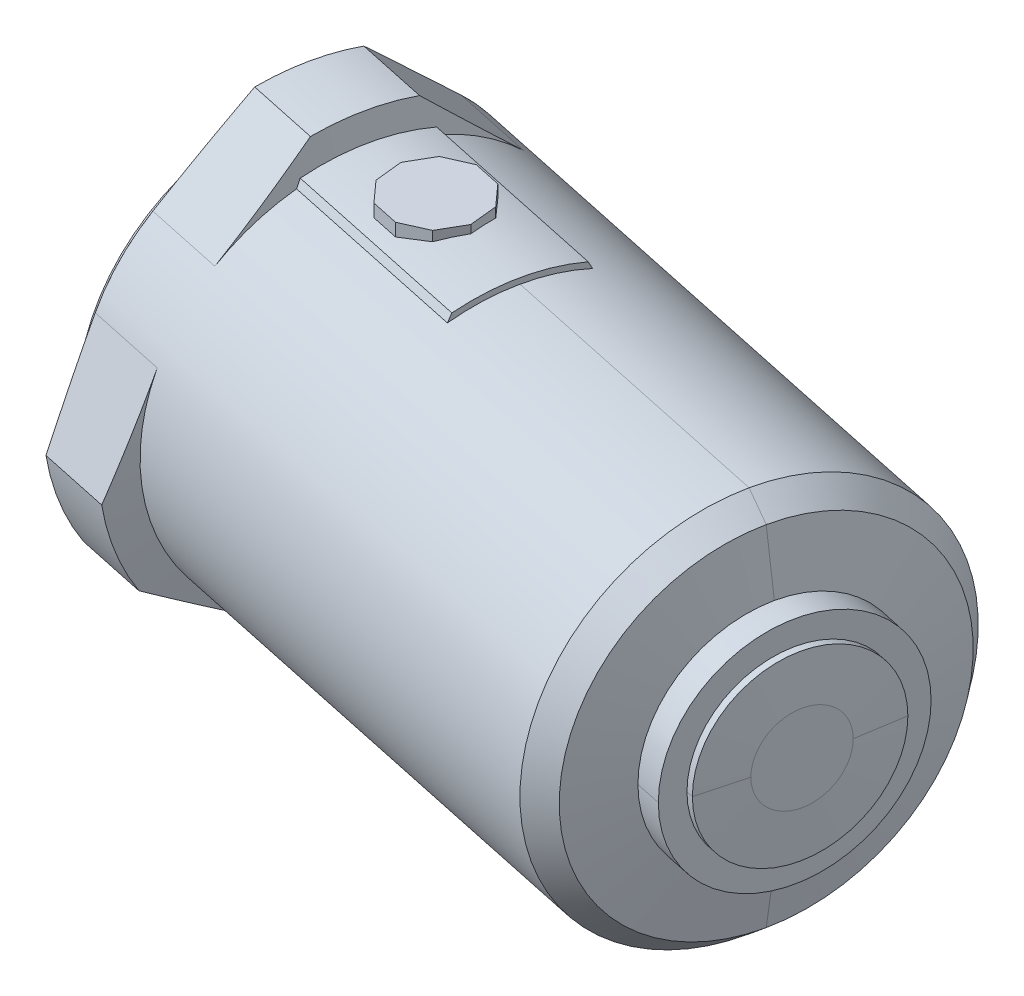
ISO-10303-21;
HEADER;
FILE_DESCRIPTION(('STEP AP214'),'2;1');
FILE_NAME('part.step','',(''),(''),'','','');
FILE_SCHEMA(('AUTOMOTIVE_DESIGN { 1 0 10303 214 1 1 1 1 }'));
ENDSEC;
DATA;
#1=APPLICATION_CONTEXT('core data for automotive mechanical design processes');
#2=APPLICATION_PROTOCOL_DEFINITION('international standard','automotive_design',2000,#1);
#3=PRODUCT_CONTEXT('',#1,'mechanical');
#4=PRODUCT('Part','Part','',(#3));
#5=PRODUCT_RELATED_PRODUCT_CATEGORY('part','',(#4));
#6=PRODUCT_DEFINITION_FORMATION('','',#4);
#7=PRODUCT_DEFINITION_CONTEXT('part definition',#1,'design');
#8=PRODUCT_DEFINITION('design','',#6,#7);
#9=PRODUCT_DEFINITION_SHAPE('','',#8);
#10=(LENGTH_UNIT() NAMED_UNIT(*) SI_UNIT(.MILLI.,.METRE.));
#11=(NAMED_UNIT(*) PLANE_ANGLE_UNIT() SI_UNIT($,.RADIAN.));
#12=(NAMED_UNIT(*) SI_UNIT($,.STERADIAN.) SOLID_ANGLE_UNIT());
#13=UNCERTAINTY_MEASURE_WITH_UNIT(LENGTH_MEASURE(1.E-05),#10,'distance_accuracy_value','');
#14=(GEOMETRIC_REPRESENTATION_CONTEXT(3) GLOBAL_UNCERTAINTY_ASSIGNED_CONTEXT((#13)) GLOBAL_UNIT_ASSIGNED_CONTEXT((#10,
#11,#12)) REPRESENTATION_CONTEXT('',''));
#15=CARTESIAN_POINT('',(0.,0.,0.));
#16=DIRECTION('',(0.,0.,1.));
#17=DIRECTION('',(1.,0.,0.));
#18=AXIS2_PLACEMENT_3D('',#15,#16,#17);
#19=CARTESIAN_POINT('',(118.254811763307,-210.000000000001,737.125925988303));
#20=DIRECTION('',(0.978172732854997,0.,0.207793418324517));
#21=DIRECTION('',(0.207793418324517,0.,-0.978172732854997));
#22=AXIS2_PLACEMENT_3D('',#19,#20,#21);
#23=PLANE('',#22);
#24=CARTESIAN_POINT('',(118.254811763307,-210.000000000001,737.125925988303));
#25=DIRECTION('',(0.978172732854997,0.,0.207793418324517));
#26=DIRECTION('',(0.207793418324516,0.,-0.978172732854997));
#27=AXIS2_PLACEMENT_3D('',#24,#25,#26);
#28=CIRCLE('',#27,37.5);
#29=CARTESIAN_POINT('',(110.462558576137,-210.000000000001,773.807403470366));
#30=VERTEX_POINT('',#29);
#31=CARTESIAN_POINT('',(126.047064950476,-210.000000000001,700.444448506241));
#32=VERTEX_POINT('',#31);
#33=EDGE_CURVE('E10',#30,#32,#28,.T.);
#34=ORIENTED_EDGE('',*,*,#33,.T.);
#35=CARTESIAN_POINT('',(118.254811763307,-210.000000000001,737.125925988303));
#36=DIRECTION('',(0.978172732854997,0.,0.207793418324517));
#37=DIRECTION('',(0.207793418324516,0.,-0.978172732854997));
#38=AXIS2_PLACEMENT_3D('',#35,#36,#37);
#39=CIRCLE('',#38,37.5);
#40=EDGE_CURVE('E31',#32,#30,#39,.T.);
#41=ORIENTED_EDGE('',*,*,#40,.T.);
#42=EDGE_LOOP('',(#34,#41));
#43=FACE_BOUND('',#42,.T.);
#44=ADVANCED_FACE('F16',(#43),#23,.T.);
#45=CARTESIAN_POINT('',(116.127361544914,-210.000000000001,736.673991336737));
#46=DIRECTION('',(-0.978172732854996,0.,-0.207793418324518));
#47=DIRECTION('',(-0.207793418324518,0.,0.978172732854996));
#48=AXIS2_PLACEMENT_3D('',#45,#46,#47);
#49=CONICAL_SURFACE('',#48,78.9999999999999,1.51843644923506);
#50=DIRECTION('',(-0.156315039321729,0.,0.9877072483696));
#51=VECTOR('',#50,1.);
#52=CARTESIAN_POINT('',(132.543041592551,-210.000000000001,659.398345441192));
#53=LINE('',#52,#51);
#54=CARTESIAN_POINT('',(132.543041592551,-210.000000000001,659.398345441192));
#55=VERTEX_POINT('',#54);
#56=EDGE_CURVE('E40',#55,#32,#53,.T.);
#57=ORIENTED_EDGE('',*,*,#56,.F.);
#58=CARTESIAN_POINT('',(116.127361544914,-210.000000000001,736.673991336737));
#59=DIRECTION('',(0.978172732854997,0.,0.207793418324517));
#60=DIRECTION('',(0.207793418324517,0.,-0.978172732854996));
#61=AXIS2_PLACEMENT_3D('',#58,#59,#60);
#62=CIRCLE('',#61,79.);
#63=CARTESIAN_POINT('',(99.7116814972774,-210.000000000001,813.949637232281));
#64=VERTEX_POINT('',#63);
#65=EDGE_CURVE('E1165',#55,#64,#62,.T.);
#66=ORIENTED_EDGE('',*,*,#65,.T.);
#67=DIRECTION('',(0.25870225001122,0.,-0.96595711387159));
#68=VECTOR('',#67,1.);
#69=CARTESIAN_POINT('',(99.7116814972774,-210.000000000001,813.949637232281));
#70=LINE('',#69,#68);
#71=EDGE_CURVE('E735',#64,#30,#70,.T.);
#72=ORIENTED_EDGE('',*,*,#71,.T.);
#73=ORIENTED_EDGE('',*,*,#40,.F.);
#74=EDGE_LOOP('',(#57,#66,#72,#73));
#75=FACE_BOUND('',#74,.T.);
#76=ADVANCED_FACE('F472',(#75),#49,.T.);
#77=CARTESIAN_POINT('',(116.127361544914,-210.000000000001,736.673991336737));
#78=DIRECTION('',(-0.978172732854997,0.,-0.207793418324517));
#79=DIRECTION('',(-0.207793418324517,0.,0.978172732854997));
#80=AXIS2_PLACEMENT_3D('',#77,#78,#79);
#81=CONICAL_SURFACE('',#80,79.0000000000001,1.51843644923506);
#82=CARTESIAN_POINT('',(116.127361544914,-210.000000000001,736.673991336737));
#83=DIRECTION('',(0.978172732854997,0.,0.207793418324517));
#84=DIRECTION('',(0.207793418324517,0.,-0.978172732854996));
#85=AXIS2_PLACEMENT_3D('',#82,#83,#84);
#86=CIRCLE('',#85,79.);
#87=EDGE_CURVE('E733',#64,#55,#86,.T.);
#88=ORIENTED_EDGE('',*,*,#87,.T.);
#89=ORIENTED_EDGE('',*,*,#56,.T.);
#90=ORIENTED_EDGE('',*,*,#33,.F.);
#91=ORIENTED_EDGE('',*,*,#71,.F.);
#92=EDGE_LOOP('',(#88,#89,#90,#91));
#93=FACE_BOUND('',#92,.T.);
#94=ADVANCED_FACE('F476',(#93),#81,.T.);
#95=CARTESIAN_POINT('',(-481.634546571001,-209.999999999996,609.691316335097));
#96=DIRECTION('',(-0.978172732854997,0.,-0.207793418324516));
#97=DIRECTION('',(-0.207793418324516,0.,0.978172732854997));
#98=AXIS2_PLACEMENT_3D('',#95,#96,#97);
#99=PLANE('',#98);
#100=CARTESIAN_POINT('',(-481.634546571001,-209.999999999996,609.691316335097));
#101=DIRECTION('',(0.978172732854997,0.,0.207793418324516));
#102=DIRECTION('',(0.207793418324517,0.,-0.978172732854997));
#103=AXIS2_PLACEMENT_3D('',#100,#101,#102);
#104=CIRCLE('',#103,40.9999999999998);
#105=CARTESIAN_POINT('',(-473.115016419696,-209.999999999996,569.586234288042));
#106=VERTEX_POINT('',#105);
#107=CARTESIAN_POINT('',(-490.154076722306,-209.999999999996,649.796398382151));
#108=VERTEX_POINT('',#107);
#109=EDGE_CURVE('E736',#106,#108,#104,.T.);
#110=ORIENTED_EDGE('',*,*,#109,.F.);
#111=CARTESIAN_POINT('',(-481.634546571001,-209.999999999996,609.691316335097));
#112=DIRECTION('',(0.978172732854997,0.,0.207793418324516));
#113=DIRECTION('',(0.207793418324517,0.,-0.978172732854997));
#114=AXIS2_PLACEMENT_3D('',#111,#112,#113);
#115=CIRCLE('',#114,40.9999999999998);
#116=EDGE_CURVE('E698',#108,#106,#115,.T.);
#117=ORIENTED_EDGE('',*,*,#116,.F.);
#118=EDGE_LOOP('',(#110,#117));
#119=FACE_BOUND('',#118,.T.);
#120=ADVANCED_FACE('F480',(#119),#99,.T.);
#121=CARTESIAN_POINT('',(110.159956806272,-210.000000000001,735.40633442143));
#122=DIRECTION('',(0.978172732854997,0.,0.207793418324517));
#123=DIRECTION('',(0.207793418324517,0.,-0.978172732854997));
#124=AXIS2_PLACEMENT_3D('',#121,#122,#123);
#125=CYLINDRICAL_SURFACE('',#124,79.);
#126=CARTESIAN_POINT('',(110.159956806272,-210.000000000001,735.40633442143));
#127=DIRECTION('',(0.978172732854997,0.,0.207793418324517));
#128=DIRECTION('',(0.207793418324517,0.,-0.978172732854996));
#129=AXIS2_PLACEMENT_3D('',#126,#127,#128);
#130=CIRCLE('',#129,79.);
#131=CARTESIAN_POINT('',(126.575636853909,-210.000000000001,658.130688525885));
#132=VERTEX_POINT('',#131);
#133=CARTESIAN_POINT('',(93.7442767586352,-210.000000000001,812.681980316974));
#134=VERTEX_POINT('',#133);
#135=EDGE_CURVE('E1022',#132,#134,#130,.T.);
#136=ORIENTED_EDGE('',*,*,#135,.T.);
#137=DIRECTION('',(0.978172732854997,0.,0.207793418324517));
#138=VECTOR('',#137,1.);
#139=CARTESIAN_POINT('',(119.782272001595,-210.000000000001,818.213236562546));
#140=LINE('',#139,#138);
#141=EDGE_CURVE('E1028',#134,#64,#140,.T.);
#142=ORIENTED_EDGE('',*,*,#141,.T.);
#143=ORIENTED_EDGE('',*,*,#65,.F.);
#144=DIRECTION('',(0.978172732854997,0.,0.207793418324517));
#145=VECTOR('',#144,1.);
#146=CARTESIAN_POINT('',(152.613632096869,-210.000000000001,663.661944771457));
#147=LINE('',#146,#145);
#148=EDGE_CURVE('E697',#132,#55,#147,.T.);
#149=ORIENTED_EDGE('',*,*,#148,.F.);
#150=EDGE_LOOP('',(#136,#142,#143,#149));
#151=FACE_BOUND('',#150,.T.);
#152=ADVANCED_FACE('F481',(#151),#125,.T.);
#153=CARTESIAN_POINT('',(110.159956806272,-210.000000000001,735.40633442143));
#154=DIRECTION('',(0.978172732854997,0.,0.207793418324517));
#155=DIRECTION('',(0.207793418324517,0.,-0.978172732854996));
#156=AXIS2_PLACEMENT_3D('',#153,#154,#155);
#157=CYLINDRICAL_SURFACE('',#156,79.);
#158=ORIENTED_EDGE('',*,*,#141,.F.);
#159=CARTESIAN_POINT('',(110.159956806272,-210.000000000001,735.40633442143));
#160=DIRECTION('',(0.978172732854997,0.,0.207793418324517));
#161=DIRECTION('',(0.207793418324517,0.,-0.978172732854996));
#162=AXIS2_PLACEMENT_3D('',#159,#160,#161);
#163=CIRCLE('',#162,79.);
#164=EDGE_CURVE('E1070',#134,#132,#163,.T.);
#165=ORIENTED_EDGE('',*,*,#164,.T.);
#166=ORIENTED_EDGE('',*,*,#148,.T.);
#167=ORIENTED_EDGE('',*,*,#87,.F.);
#168=EDGE_LOOP('',(#158,#165,#166,#167));
#169=FACE_BOUND('',#168,.T.);
#170=ADVANCED_FACE('F484',(#169),#157,.T.);
#171=CARTESIAN_POINT('',(-448.376673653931,-209.999999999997,616.756292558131));
#172=DIRECTION('',(0.978172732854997,0.,0.207793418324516));
#173=DIRECTION('',(0.207793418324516,0.,-0.978172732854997));
#174=AXIS2_PLACEMENT_3D('',#171,#172,#173);
#175=CONICAL_SURFACE('',#174,90.4005494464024,0.967998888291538);
#176=CARTESIAN_POINT('',(-448.376673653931,-209.999999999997,616.756292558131));
#177=DIRECTION('',(0.978172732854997,0.,0.207793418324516));
#178=DIRECTION('',(0.207793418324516,0.,-0.978172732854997));
#179=AXIS2_PLACEMENT_3D('',#176,#177,#178);
#180=CIRCLE('',#179,90.4005494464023);
#181=CARTESIAN_POINT('',(-467.161312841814,-209.999999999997,705.183645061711));
#182=VERTEX_POINT('',#181);
#183=CARTESIAN_POINT('',(-429.592034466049,-209.999999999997,528.32894005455));
#184=VERTEX_POINT('',#183);
#185=EDGE_CURVE('E945',#182,#184,#180,.T.);
#186=ORIENTED_EDGE('',*,*,#185,.F.);
#187=DIRECTION('',(-0.3834037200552,0.,-0.923580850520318));
#188=VECTOR('',#187,1.);
#189=CARTESIAN_POINT('',(-490.154076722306,-209.999999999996,649.796398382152));
#190=LINE('',#189,#188);
#191=EDGE_CURVE('E694',#182,#108,#190,.T.);
#192=ORIENTED_EDGE('',*,*,#191,.T.);
#193=ORIENTED_EDGE('',*,*,#116,.T.);
#194=DIRECTION('',(-0.725744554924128,0.,0.687964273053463));
#195=VECTOR('',#194,1.);
#196=CARTESIAN_POINT('',(-473.115016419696,-209.999999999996,569.586234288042));
#197=LINE('',#196,#195);
#198=EDGE_CURVE('E739',#184,#106,#197,.T.);
#199=ORIENTED_EDGE('',*,*,#198,.F.);
#200=EDGE_LOOP('',(#186,#192,#193,#199));
#201=FACE_BOUND('',#200,.T.);
#202=ADVANCED_FACE('F488',(#201),#175,.T.);
#203=CARTESIAN_POINT('',(-448.376673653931,-209.999999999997,616.756292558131));
#204=DIRECTION('',(0.978172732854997,0.,0.207793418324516));
#205=DIRECTION('',(0.207793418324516,0.,-0.978172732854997));
#206=AXIS2_PLACEMENT_3D('',#203,#204,#205);
#207=CONICAL_SURFACE('',#206,90.4005494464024,0.967998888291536);
#208=ORIENTED_EDGE('',*,*,#191,.F.);
#209=CARTESIAN_POINT('',(-448.376673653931,-209.999999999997,616.756292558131));
#210=DIRECTION('',(0.978172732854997,0.,0.207793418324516));
#211=DIRECTION('',(0.207793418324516,0.,-0.978172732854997));
#212=AXIS2_PLACEMENT_3D('',#209,#210,#211);
#213=CIRCLE('',#212,90.4005494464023);
#214=EDGE_CURVE('E921',#184,#182,#213,.T.);
#215=ORIENTED_EDGE('',*,*,#214,.F.);
#216=ORIENTED_EDGE('',*,*,#198,.T.);
#217=ORIENTED_EDGE('',*,*,#109,.T.);
#218=EDGE_LOOP('',(#208,#215,#216,#217));
#219=FACE_BOUND('',#218,.T.);
#220=ADVANCED_FACE('F492',(#219),#207,.T.);
#221=CARTESIAN_POINT('',(89.3806149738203,-210.000000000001,833.223607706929));
#222=DIRECTION('',(0.978172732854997,0.,0.207793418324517));
#223=DIRECTION('',(0.207793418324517,0.,-0.978172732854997));
#224=AXIS2_PLACEMENT_3D('',#221,#222,#223);
#225=PLANE('',#224);
#226=ORIENTED_EDGE('',*,*,#135,.F.);
#227=ORIENTED_EDGE('',*,*,#164,.F.);
#228=EDGE_LOOP('',(#226,#227));
#229=FACE_BOUND('',#228,.T.);
#230=CARTESIAN_POINT('',(110.159956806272,-210.000000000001,735.40633442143));
#231=DIRECTION('',(0.978172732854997,0.,0.207793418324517));
#232=DIRECTION('',(0.207793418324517,0.,-0.978172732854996));
#233=AXIS2_PLACEMENT_3D('',#230,#231,#232);
#234=CIRCLE('',#233,100.);
#235=CARTESIAN_POINT('',(130.939298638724,-210.000000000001,637.58906113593));
#236=VERTEX_POINT('',#235);
#237=CARTESIAN_POINT('',(89.3806149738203,-210.000000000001,833.223607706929));
#238=VERTEX_POINT('',#237);
#239=EDGE_CURVE('E740',#236,#238,#234,.T.);
#240=ORIENTED_EDGE('',*,*,#239,.T.);
#241=CARTESIAN_POINT('',(110.159956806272,-210.000000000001,735.40633442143));
#242=DIRECTION('',(0.978172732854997,0.,0.207793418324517));
#243=DIRECTION('',(0.207793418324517,0.,-0.978172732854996));
#244=AXIS2_PLACEMENT_3D('',#241,#242,#243);
#245=CIRCLE('',#244,100.);
#246=EDGE_CURVE('E1098',#238,#236,#245,.T.);
#247=ORIENTED_EDGE('',*,*,#246,.T.);
#248=EDGE_LOOP('',(#240,#247));
#249=FACE_BOUND('',#248,.T.);
#250=ADVANCED_FACE('F496',(#229,#249),#225,.T.);
#251=CARTESIAN_POINT('',(-310.454318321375,-29.9999999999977,646.055164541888));
#252=DIRECTION('',(0.,1.,0.));
#253=DIRECTION('',(0.,0.,1.));
#254=AXIS2_PLACEMENT_3D('',#251,#252,#253);
#255=PLANE('',#254);
#256=DIRECTION('',(0.499895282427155,0.,-0.866085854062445));
#257=VECTOR('',#256,1.);
#258=CARTESIAN_POINT('',(-259.612748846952,-29.9999999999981,680.548886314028));
#259=LINE('',#258,#257);
#260=CARTESIAN_POINT('',(-259.612748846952,-29.9999999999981,680.548886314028));
#261=VERTEX_POINT('',#260);
#262=CARTESIAN_POINT('',(-247.430812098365,-29.9999999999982,659.443259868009));
#263=VERTEX_POINT('',#262);
#264=EDGE_CURVE('E1101',#261,#263,#259,.T.);
#265=ORIENTED_EDGE('',*,*,#264,.T.);
#266=DIRECTION('',(-0.104648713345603,0.,-0.994509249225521));
#267=VECTOR('',#266,1.);
#268=CARTESIAN_POINT('',(-247.430812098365,-29.9999999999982,659.443259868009));
#269=LINE('',#268,#267);
#270=CARTESIAN_POINT('',(-249.980994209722,-29.9999999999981,635.208086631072));
#271=VERTEX_POINT('',#270);
#272=EDGE_CURVE('E951',#263,#271,#269,.T.);
#273=ORIENTED_EDGE('',*,*,#272,.T.);
#274=DIRECTION('',(-0.669220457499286,0.,-0.743063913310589));
#275=VECTOR('',#274,1.);
#276=CARTESIAN_POINT('',(-249.980994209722,-29.9999999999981,635.208086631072));
#277=LINE('',#276,#275);
#278=CARTESIAN_POINT('',(-266.289212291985,-29.999999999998,617.100379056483));
#279=VERTEX_POINT('',#278);
#280=EDGE_CURVE('E707',#271,#279,#277,.T.);
#281=ORIENTED_EDGE('',*,*,#280,.T.);
#282=DIRECTION('',(-0.978172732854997,0.,-0.207793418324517));
#283=VECTOR('',#282,1.);
#284=CARTESIAN_POINT('',(-266.289212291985,-29.999999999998,617.100379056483));
#285=LINE('',#284,#283);
#286=CARTESIAN_POINT('',(-290.126281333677,-29.9999999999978,612.036665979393));
#287=VERTEX_POINT('',#286);
#288=EDGE_CURVE('E704',#279,#287,#285,.T.);
#289=ORIENTED_EDGE('',*,*,#288,.T.);
#290=DIRECTION('',(-0.913496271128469,0.,0.406847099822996));
#291=VECTOR('',#290,1.);
#292=CARTESIAN_POINT('',(-290.126281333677,-29.9999999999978,612.036665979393));
#293=LINE('',#292,#291);
#294=CARTESIAN_POINT('',(-312.387251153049,-29.9999999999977,621.951113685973));
#295=VERTEX_POINT('',#294);
#296=EDGE_CURVE('E708',#287,#295,#293,.T.);
#297=ORIENTED_EDGE('',*,*,#296,.T.);
#298=DIRECTION('',(-0.499895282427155,0.,0.866085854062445));
#299=VECTOR('',#298,1.);
#300=CARTESIAN_POINT('',(-312.387251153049,-29.9999999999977,621.951113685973));
#301=LINE('',#300,#299);
#302=CARTESIAN_POINT('',(-324.569187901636,-29.9999999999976,643.056740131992));
#303=VERTEX_POINT('',#302);
#304=EDGE_CURVE('E1157',#295,#303,#301,.T.);
#305=ORIENTED_EDGE('',*,*,#304,.T.);
#306=DIRECTION('',(0.104648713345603,0.,0.994509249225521));
#307=VECTOR('',#306,1.);
#308=CARTESIAN_POINT('',(-324.569187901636,-29.9999999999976,643.056740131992));
#309=LINE('',#308,#307);
#310=CARTESIAN_POINT('',(-322.019005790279,-29.9999999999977,667.29191336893));
#311=VERTEX_POINT('',#310);
#312=EDGE_CURVE('E702',#303,#311,#309,.T.);
#313=ORIENTED_EDGE('',*,*,#312,.T.);
#314=DIRECTION('',(0.669220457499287,0.,0.743063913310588));
#315=VECTOR('',#314,1.);
#316=CARTESIAN_POINT('',(-322.019005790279,-29.9999999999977,667.29191336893));
#317=LINE('',#316,#315);
#318=CARTESIAN_POINT('',(-305.710787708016,-29.9999999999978,685.399620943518));
#319=VERTEX_POINT('',#318);
#320=EDGE_CURVE('E699',#311,#319,#317,.T.);
#321=ORIENTED_EDGE('',*,*,#320,.T.);
#322=DIRECTION('',(0.978172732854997,0.,0.207793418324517));
#323=VECTOR('',#322,1.);
#324=CARTESIAN_POINT('',(-305.710787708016,-29.9999999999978,685.399620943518));
#325=LINE('',#324,#323);
#326=CARTESIAN_POINT('',(-281.873718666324,-29.999999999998,690.463334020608));
#327=VERTEX_POINT('',#326);
#328=EDGE_CURVE('E703',#319,#327,#325,.T.);
#329=ORIENTED_EDGE('',*,*,#328,.T.);
#330=DIRECTION('',(0.913496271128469,0.,-0.406847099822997));
#331=VECTOR('',#330,1.);
#332=CARTESIAN_POINT('',(-281.873718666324,-29.999999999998,690.463334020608));
#333=LINE('',#332,#331);
#334=EDGE_CURVE('E918',#327,#261,#333,.T.);
#335=ORIENTED_EDGE('',*,*,#334,.T.);
#336=EDGE_LOOP('',(#265,#273,#281,#289,#297,#305,#313,#321,#329,#335));
#337=FACE_BOUND('',#336,.T.);
#338=ADVANCED_FACE('F549',(#337),#255,.T.);
#339=CARTESIAN_POINT('',(-467.161312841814,-209.999999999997,705.183645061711));
#340=DIRECTION('',(-0.978172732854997,0.,-0.207793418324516));
#341=DIRECTION('',(-0.207793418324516,0.,0.978172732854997));
#342=AXIS2_PLACEMENT_3D('',#339,#340,#341);
#343=PLANE('',#342);
#344=CARTESIAN_POINT('',(-448.376673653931,-209.999999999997,616.756292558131));
#345=DIRECTION('',(0.978172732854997,0.,0.207793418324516));
#346=DIRECTION('',(0.207793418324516,0.,-0.978172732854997));
#347=AXIS2_PLACEMENT_3D('',#344,#345,#346);
#348=CIRCLE('',#347,100.104815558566);
#349=CARTESIAN_POINT('',(-427.575551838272,-209.999999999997,518.836491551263));
#350=VERTEX_POINT('',#349);
#351=CARTESIAN_POINT('',(-469.177795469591,-209.999999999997,714.676093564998));
#352=VERTEX_POINT('',#351);
#353=EDGE_CURVE('E714',#350,#352,#348,.T.);
#354=ORIENTED_EDGE('',*,*,#353,.F.);
#355=CARTESIAN_POINT('',(-448.376673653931,-209.999999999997,616.756292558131));
#356=DIRECTION('',(0.978172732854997,0.,0.207793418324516));
#357=DIRECTION('',(0.207793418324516,0.,-0.978172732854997));
#358=AXIS2_PLACEMENT_3D('',#355,#356,#357);
#359=CIRCLE('',#358,100.104815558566);
#360=EDGE_CURVE('E1058',#352,#350,#359,.T.);
#361=ORIENTED_EDGE('',*,*,#360,.F.);
#362=EDGE_LOOP('',(#354,#361));
#363=FACE_BOUND('',#362,.T.);
#364=ORIENTED_EDGE('',*,*,#214,.T.);
#365=ORIENTED_EDGE('',*,*,#185,.T.);
#366=EDGE_LOOP('',(#364,#365));
#367=FACE_BOUND('',#366,.T.);
#368=ADVANCED_FACE('F502',(#363,#367),#343,.T.);
#369=CARTESIAN_POINT('',(87.6524317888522,-210.000000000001,730.625056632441));
#370=DIRECTION('',(0.978172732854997,0.,0.207793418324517));
#371=DIRECTION('',(0.207793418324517,0.,-0.978172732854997));
#372=AXIS2_PLACEMENT_3D('',#369,#370,#371);
#373=CYLINDRICAL_SURFACE('',#372,100.);
#374=CARTESIAN_POINT('',(87.6524317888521,-210.000000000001,730.625056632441));
#375=DIRECTION('',(0.978172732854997,0.,0.207793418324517));
#376=DIRECTION('',(0.207793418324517,0.,-0.978172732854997));
#377=AXIS2_PLACEMENT_3D('',#374,#375,#376);
#378=CIRCLE('',#377,100.);
#379=CARTESIAN_POINT('',(108.431773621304,-210.000000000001,632.807783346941));
#380=VERTEX_POINT('',#379);
#381=CARTESIAN_POINT('',(87.6524317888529,-110.000000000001,730.625056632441));
#382=VERTEX_POINT('',#381);
#383=EDGE_CURVE('E948',#380,#382,#378,.T.);
#384=ORIENTED_EDGE('',*,*,#383,.T.);
#385=CARTESIAN_POINT('',(87.6524317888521,-210.000000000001,730.625056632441));
#386=DIRECTION('',(0.978172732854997,0.,0.207793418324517));
#387=DIRECTION('',(0.207793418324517,0.,-0.978172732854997));
#388=AXIS2_PLACEMENT_3D('',#385,#386,#387);
#389=CIRCLE('',#388,100.);
#390=CARTESIAN_POINT('',(66.8730899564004,-210.000000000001,828.442329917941));
#391=VERTEX_POINT('',#390);
#392=EDGE_CURVE('E1033',#382,#391,#389,.T.);
#393=ORIENTED_EDGE('',*,*,#392,.T.);
#394=DIRECTION('',(0.978172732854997,0.,0.207793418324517));
#395=VECTOR('',#394,1.);
#396=CARTESIAN_POINT('',(115.41861021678,-210.000000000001,838.754863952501));
#397=LINE('',#396,#395);
#398=EDGE_CURVE('E925',#391,#238,#397,.T.);
#399=ORIENTED_EDGE('',*,*,#398,.T.);
#400=ORIENTED_EDGE('',*,*,#239,.F.);
#401=DIRECTION('',(0.978172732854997,0.,0.207793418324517));
#402=VECTOR('',#401,1.);
#403=CARTESIAN_POINT('',(156.977293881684,-210.000000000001,643.120317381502));
#404=LINE('',#403,#402);
#405=EDGE_CURVE('E741',#380,#236,#404,.T.);
#406=ORIENTED_EDGE('',*,*,#405,.F.);
#407=EDGE_LOOP('',(#384,#393,#399,#400,#406));
#408=FACE_BOUND('',#407,.T.);
#409=ADVANCED_FACE('F498',(#408),#373,.T.);
#410=CARTESIAN_POINT('',(87.6524317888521,-210.000000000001,730.625056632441));
#411=DIRECTION('',(0.978172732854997,0.,0.207793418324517));
#412=DIRECTION('',(0.207793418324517,0.,-0.978172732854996));
#413=AXIS2_PLACEMENT_3D('',#410,#411,#412);
#414=CYLINDRICAL_SURFACE('',#413,100.);
#415=ORIENTED_EDGE('',*,*,#398,.F.);
#416=CARTESIAN_POINT('',(87.6524317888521,-210.000000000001,730.625056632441));
#417=DIRECTION('',(0.978172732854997,0.,0.207793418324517));
#418=DIRECTION('',(0.207793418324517,0.,-0.978172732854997));
#419=AXIS2_PLACEMENT_3D('',#416,#417,#418);
#420=CIRCLE('',#419,100.);
#421=CARTESIAN_POINT('',(87.6524317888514,-310.000000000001,730.625056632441));
#422=VERTEX_POINT('',#421);
#423=EDGE_CURVE('E922',#391,#422,#420,.T.);
#424=ORIENTED_EDGE('',*,*,#423,.T.);
#425=CARTESIAN_POINT('',(87.6524317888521,-210.000000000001,730.625056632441));
#426=DIRECTION('',(0.978172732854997,0.,0.207793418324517));
#427=DIRECTION('',(0.207793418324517,0.,-0.978172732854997));
#428=AXIS2_PLACEMENT_3D('',#425,#426,#427);
#429=CIRCLE('',#428,100.);
#430=EDGE_CURVE('E744',#422,#380,#429,.T.);
#431=ORIENTED_EDGE('',*,*,#430,.T.);
#432=ORIENTED_EDGE('',*,*,#405,.T.);
#433=ORIENTED_EDGE('',*,*,#246,.F.);
#434=EDGE_LOOP('',(#415,#424,#431,#432,#433));
#435=FACE_BOUND('',#434,.T.);
#436=ADVANCED_FACE('F501',(#435),#414,.T.);
#437=CARTESIAN_POINT('',(-305.710787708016,-49.9999999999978,685.399620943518));
#438=DIRECTION('',(-0.207793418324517,0.,0.978172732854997));
#439=DIRECTION('',(0.978172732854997,0.,0.207793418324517));
#440=AXIS2_PLACEMENT_3D('',#437,#438,#439);
#441=PLANE('',#440);
#442=DIRECTION('',(0.978172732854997,0.,0.207793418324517));
#443=VECTOR('',#442,1.);
#444=CARTESIAN_POINT('',(-200.865843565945,-41.1132035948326,707.671852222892));
#445=LINE('',#444,#443);
#446=CARTESIAN_POINT('',(-305.710787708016,-41.1132035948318,685.399620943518));
#447=VERTEX_POINT('',#446);
#448=CARTESIAN_POINT('',(-281.873718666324,-41.1132035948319,690.463334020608));
#449=VERTEX_POINT('',#448);
#450=EDGE_CURVE('E745',#447,#449,#445,.T.);
#451=ORIENTED_EDGE('',*,*,#450,.T.);
#452=DIRECTION('',(0.,1.,0.));
#453=VECTOR('',#452,1.);
#454=CARTESIAN_POINT('',(-281.873718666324,-49.999999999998,690.463334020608));
#455=LINE('',#454,#453);
#456=EDGE_CURVE('E746',#449,#327,#455,.T.);
#457=ORIENTED_EDGE('',*,*,#456,.T.);
#458=ORIENTED_EDGE('',*,*,#328,.F.);
#459=DIRECTION('',(0.,1.,0.));
#460=VECTOR('',#459,1.);
#461=CARTESIAN_POINT('',(-305.710787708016,-49.9999999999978,685.399620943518));
#462=LINE('',#461,#460);
#463=EDGE_CURVE('E997',#447,#319,#462,.T.);
#464=ORIENTED_EDGE('',*,*,#463,.F.);
#465=EDGE_LOOP('',(#451,#457,#458,#464));
#466=FACE_BOUND('',#465,.T.);
#467=ADVANCED_FACE('F506',(#466),#441,.T.);
#468=CARTESIAN_POINT('',(-247.430812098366,-49.9999999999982,659.443259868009));
#469=DIRECTION('',(0.994509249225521,0.,-0.104648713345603));
#470=DIRECTION('',(-0.104648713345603,0.,-0.994509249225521));
#471=AXIS2_PLACEMENT_3D('',#468,#469,#470);
#472=PLANE('',#471);
#473=CARTESIAN_POINT('',(-247.430812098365,-36.9999999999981,659.443259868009));
#474=CARTESIAN_POINT('',(-248.284078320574,-36.9999999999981,651.334405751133));
#475=CARTESIAN_POINT('',(-249.135419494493,-37.5206015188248,643.243845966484));
#476=CARTESIAN_POINT('',(-249.980994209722,-38.5594555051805,635.208086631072));
#477=(BOUNDED_CURVE() B_SPLINE_CURVE(3,(#473,#474,#475,#476),.UNSPECIFIED.,.F.,
.F.) B_SPLINE_CURVE_WITH_KNOTS((4,4),(4.71238898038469,4.84675987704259),
.UNSPECIFIED.) CURVE() GEOMETRIC_REPRESENTATION_ITEM() RATIONAL_B_SPLINE_CURVE((1.,
0.9984959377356,0.9984959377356,1.)) REPRESENTATION_ITEM(''));
#478=CARTESIAN_POINT('',(-247.430812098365,-36.9999999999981,659.443259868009));
#479=VERTEX_POINT('',#478);
#480=CARTESIAN_POINT('',(-249.980994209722,-38.5594555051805,635.208086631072));
#481=VERTEX_POINT('',#480);
#482=EDGE_CURVE('E749',#479,#481,#477,.T.);
#483=ORIENTED_EDGE('',*,*,#482,.T.);
#484=DIRECTION('',(0.,1.,0.));
#485=VECTOR('',#484,1.);
#486=CARTESIAN_POINT('',(-249.980994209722,-49.9999999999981,635.208086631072));
#487=LINE('',#486,#485);
#488=EDGE_CURVE('E965',#481,#271,#487,.T.);
#489=ORIENTED_EDGE('',*,*,#488,.T.);
#490=ORIENTED_EDGE('',*,*,#272,.F.);
#491=DIRECTION('',(0.,1.,0.));
#492=VECTOR('',#491,1.);
#493=CARTESIAN_POINT('',(-247.430812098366,-49.9999999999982,659.443259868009));
#494=LINE('',#493,#492);
#495=EDGE_CURVE('E1011',#479,#263,#494,.T.);
#496=ORIENTED_EDGE('',*,*,#495,.F.);
#497=EDGE_LOOP('',(#483,#489,#490,#496));
#498=FACE_BOUND('',#497,.T.);
#499=ADVANCED_FACE('F559',(#498),#472,.T.);
#500=CARTESIAN_POINT('',(-259.612748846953,-49.9999999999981,680.548886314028));
#501=DIRECTION('',(0.866085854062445,0.,0.499895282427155));
#502=DIRECTION('',(0.499895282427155,0.,-0.866085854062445));
#503=AXIS2_PLACEMENT_3D('',#500,#501,#502);
#504=PLANE('',#503);
#505=CARTESIAN_POINT('',(-259.612748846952,-38.5594555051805,680.548886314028));
#506=CARTESIAN_POINT('',(-255.573532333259,-37.5206015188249,673.55080410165));
#507=CARTESIAN_POINT('',(-251.506770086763,-36.9999999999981,666.504997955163));
#508=CARTESIAN_POINT('',(-247.430812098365,-36.9999999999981,659.443259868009));
#509=(BOUNDED_CURVE() B_SPLINE_CURVE(3,(#505,#506,#507,#508),.UNSPECIFIED.,.F.,
.F.) B_SPLINE_CURVE_WITH_KNOTS((4,4),(1.436425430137,1.5707963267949),
.UNSPECIFIED.) CURVE() GEOMETRIC_REPRESENTATION_ITEM() RATIONAL_B_SPLINE_CURVE((1.,
0.9984959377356,0.9984959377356,1.)) REPRESENTATION_ITEM(''));
#510=CARTESIAN_POINT('',(-259.612748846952,-38.5594555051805,680.548886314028));
#511=VERTEX_POINT('',#510);
#512=EDGE_CURVE('E1080',#511,#479,#509,.T.);
#513=ORIENTED_EDGE('',*,*,#512,.T.);
#514=ORIENTED_EDGE('',*,*,#495,.T.);
#515=ORIENTED_EDGE('',*,*,#264,.F.);
#516=DIRECTION('',(0.,1.,0.));
#517=VECTOR('',#516,1.);
#518=CARTESIAN_POINT('',(-259.612748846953,-49.9999999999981,680.548886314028));
#519=LINE('',#518,#517);
#520=EDGE_CURVE('E755',#511,#261,#519,.T.);
#521=ORIENTED_EDGE('',*,*,#520,.F.);
#522=EDGE_LOOP('',(#513,#514,#515,#521));
#523=FACE_BOUND('',#522,.T.);
#524=ADVANCED_FACE('F563',(#523),#504,.T.);
#525=CARTESIAN_POINT('',(-312.387251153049,-49.9999999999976,621.951113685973));
#526=DIRECTION('',(-0.866085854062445,0.,-0.499895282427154));
#527=DIRECTION('',(-0.499895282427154,0.,0.866085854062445));
#528=AXIS2_PLACEMENT_3D('',#525,#526,#527);
#529=PLANE('',#528);
#530=CARTESIAN_POINT('',(-312.387251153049,-38.55945550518,621.951113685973));
#531=CARTESIAN_POINT('',(-316.426467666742,-37.5206015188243,628.949195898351));
#532=CARTESIAN_POINT('',(-320.493229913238,-36.9999999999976,635.995002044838));
#533=CARTESIAN_POINT('',(-324.569187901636,-36.9999999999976,643.056740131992));
#534=(BOUNDED_CURVE() B_SPLINE_CURVE(3,(#530,#531,#532,#533),.UNSPECIFIED.,.F.,
.F.) B_SPLINE_CURVE_WITH_KNOTS((4,4),(4.57801808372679,4.71238898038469),
.UNSPECIFIED.) CURVE() GEOMETRIC_REPRESENTATION_ITEM() RATIONAL_B_SPLINE_CURVE((1.,
0.9984959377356,0.9984959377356,1.)) REPRESENTATION_ITEM(''));
#535=CARTESIAN_POINT('',(-312.387251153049,-38.55945550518,621.951113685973));
#536=VERTEX_POINT('',#535);
#537=CARTESIAN_POINT('',(-324.569187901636,-36.9999999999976,643.056740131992));
#538=VERTEX_POINT('',#537);
#539=EDGE_CURVE('E1006',#536,#538,#534,.T.);
#540=ORIENTED_EDGE('',*,*,#539,.T.);
#541=DIRECTION('',(0.,1.,0.));
#542=VECTOR('',#541,1.);
#543=CARTESIAN_POINT('',(-324.569187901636,-49.9999999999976,643.056740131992));
#544=LINE('',#543,#542);
#545=EDGE_CURVE('E902',#538,#303,#544,.T.);
#546=ORIENTED_EDGE('',*,*,#545,.T.);
#547=ORIENTED_EDGE('',*,*,#304,.F.);
#548=DIRECTION('',(0.,1.,0.));
#549=VECTOR('',#548,1.);
#550=CARTESIAN_POINT('',(-312.387251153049,-49.9999999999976,621.951113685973));
#551=LINE('',#550,#549);
#552=EDGE_CURVE('E1142',#536,#295,#551,.T.);
#553=ORIENTED_EDGE('',*,*,#552,.F.);
#554=EDGE_LOOP('',(#540,#546,#547,#553));
#555=FACE_BOUND('',#554,.T.);
#556=ADVANCED_FACE('F567',(#555),#529,.T.);
#557=CARTESIAN_POINT('',(-281.873718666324,-49.999999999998,690.463334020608));
#558=DIRECTION('',(0.406847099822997,0.,0.913496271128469));
#559=DIRECTION('',(0.913496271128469,0.,-0.406847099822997));
#560=AXIS2_PLACEMENT_3D('',#557,#558,#559);
#561=PLANE('',#560);
#562=CARTESIAN_POINT('',(-281.873718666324,-41.1132035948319,690.463334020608));
#563=CARTESIAN_POINT('',(-274.511248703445,-40.0613119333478,687.184284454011));
#564=CARTESIAN_POINT('',(-267.086547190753,-39.2095603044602,683.877518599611));
#565=CARTESIAN_POINT('',(-259.612748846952,-38.5594555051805,680.548886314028));
#566=(BOUNDED_CURVE() B_SPLINE_CURVE(3,(#562,#563,#564,#565),.UNSPECIFIED.,.F.,
.F.) B_SPLINE_CURVE_WITH_KNOTS((4,4),(1.35229891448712,1.436425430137),
.UNSPECIFIED.) CURVE() GEOMETRIC_REPRESENTATION_ITEM() RATIONAL_B_SPLINE_CURVE((1.,
0.999410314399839,0.999410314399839,1.)) REPRESENTATION_ITEM(''));
#567=EDGE_CURVE('E897',#449,#511,#566,.T.);
#568=ORIENTED_EDGE('',*,*,#567,.T.);
#569=ORIENTED_EDGE('',*,*,#520,.T.);
#570=ORIENTED_EDGE('',*,*,#334,.F.);
#571=ORIENTED_EDGE('',*,*,#456,.F.);
#572=EDGE_LOOP('',(#568,#569,#570,#571));
#573=FACE_BOUND('',#572,.T.);
#574=ADVANCED_FACE('F571',(#573),#561,.T.);
#575=CARTESIAN_POINT('',(-249.980994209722,-49.9999999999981,635.208086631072));
#576=DIRECTION('',(0.743063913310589,0.,-0.669220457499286));
#577=DIRECTION('',(-0.669220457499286,0.,-0.743063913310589));
#578=AXIS2_PLACEMENT_3D('',#575,#576,#577);
#579=PLANE('',#578);
#580=CARTESIAN_POINT('',(-249.980994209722,-38.5594555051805,635.208086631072));
#581=CARTESIAN_POINT('',(-255.456242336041,-39.2095603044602,629.128685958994));
#582=CARTESIAN_POINT('',(-260.895522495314,-40.0613119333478,623.089222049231));
#583=CARTESIAN_POINT('',(-266.289212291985,-41.1132035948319,617.100379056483));
#584=(BOUNDED_CURVE() B_SPLINE_CURVE(3,(#580,#581,#582,#583),.UNSPECIFIED.,.F.,
.F.) B_SPLINE_CURVE_WITH_KNOTS((4,4),(4.84675987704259,4.93088639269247),
.UNSPECIFIED.) CURVE() GEOMETRIC_REPRESENTATION_ITEM() RATIONAL_B_SPLINE_CURVE((1.,
0.999410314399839,0.999410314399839,1.)) REPRESENTATION_ITEM(''));
#585=CARTESIAN_POINT('',(-266.289212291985,-41.1132035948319,617.100379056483));
#586=VERTEX_POINT('',#585);
#587=EDGE_CURVE('E750',#481,#586,#584,.T.);
#588=ORIENTED_EDGE('',*,*,#587,.T.);
#589=DIRECTION('',(0.,1.,0.));
#590=VECTOR('',#589,1.);
#591=CARTESIAN_POINT('',(-266.289212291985,-49.999999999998,617.100379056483));
#592=LINE('',#591,#590);
#593=EDGE_CURVE('E756',#586,#279,#592,.T.);
#594=ORIENTED_EDGE('',*,*,#593,.T.);
#595=ORIENTED_EDGE('',*,*,#280,.F.);
#596=ORIENTED_EDGE('',*,*,#488,.F.);
#597=EDGE_LOOP('',(#588,#594,#595,#596));
#598=FACE_BOUND('',#597,.T.);
#599=ADVANCED_FACE('F575',(#598),#579,.T.);
#600=CARTESIAN_POINT('',(-322.01900579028,-49.9999999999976,667.29191336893));
#601=DIRECTION('',(-0.743063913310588,0.,0.669220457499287));
#602=DIRECTION('',(0.669220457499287,0.,0.743063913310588));
#603=AXIS2_PLACEMENT_3D('',#600,#601,#602);
#604=PLANE('',#603);
#605=CARTESIAN_POINT('',(-322.019005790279,-38.55945550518,667.29191336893));
#606=CARTESIAN_POINT('',(-316.54375766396,-39.2095603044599,673.371314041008));
#607=CARTESIAN_POINT('',(-311.104477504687,-40.0613119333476,679.41077795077));
#608=CARTESIAN_POINT('',(-305.710787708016,-41.1132035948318,685.399620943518));
#609=(BOUNDED_CURVE() B_SPLINE_CURVE(3,(#605,#606,#607,#608),.UNSPECIFIED.,.F.,
.F.) B_SPLINE_CURVE_WITH_KNOTS((4,4),(1.7051672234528,1.78929373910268),
.UNSPECIFIED.) CURVE() GEOMETRIC_REPRESENTATION_ITEM() RATIONAL_B_SPLINE_CURVE((1.,
0.999410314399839,0.999410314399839,1.)) REPRESENTATION_ITEM(''));
#610=CARTESIAN_POINT('',(-322.019005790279,-38.55945550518,667.29191336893));
#611=VERTEX_POINT('',#610);
#612=EDGE_CURVE('E887',#611,#447,#609,.T.);
#613=ORIENTED_EDGE('',*,*,#612,.T.);
#614=ORIENTED_EDGE('',*,*,#463,.T.);
#615=ORIENTED_EDGE('',*,*,#320,.F.);
#616=DIRECTION('',(0.,1.,0.));
#617=VECTOR('',#616,1.);
#618=CARTESIAN_POINT('',(-322.01900579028,-49.9999999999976,667.29191336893));
#619=LINE('',#618,#617);
#620=EDGE_CURVE('E1134',#611,#311,#619,.T.);
#621=ORIENTED_EDGE('',*,*,#620,.F.);
#622=EDGE_LOOP('',(#613,#614,#615,#621));
#623=FACE_BOUND('',#622,.T.);
#624=ADVANCED_FACE('F579',(#623),#604,.T.);
#625=CARTESIAN_POINT('',(-324.569187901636,-49.9999999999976,643.056740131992));
#626=DIRECTION('',(-0.994509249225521,0.,0.104648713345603));
#627=DIRECTION('',(0.104648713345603,0.,0.994509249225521));
#628=AXIS2_PLACEMENT_3D('',#625,#626,#627);
#629=PLANE('',#628);
#630=CARTESIAN_POINT('',(-324.569187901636,-36.9999999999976,643.056740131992));
#631=CARTESIAN_POINT('',(-323.715921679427,-36.9999999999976,651.165594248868));
#632=CARTESIAN_POINT('',(-322.864580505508,-37.5206015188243,659.256154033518));
#633=CARTESIAN_POINT('',(-322.019005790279,-38.55945550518,667.29191336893));
#634=(BOUNDED_CURVE() B_SPLINE_CURVE(3,(#630,#631,#632,#633),.UNSPECIFIED.,.F.,
.F.) B_SPLINE_CURVE_WITH_KNOTS((4,4),(1.5707963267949,1.7051672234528),
.UNSPECIFIED.) CURVE() GEOMETRIC_REPRESENTATION_ITEM() RATIONAL_B_SPLINE_CURVE((1.,
0.9984959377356,0.9984959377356,1.)) REPRESENTATION_ITEM(''));
#635=EDGE_CURVE('E1000',#538,#611,#634,.T.);
#636=ORIENTED_EDGE('',*,*,#635,.T.);
#637=ORIENTED_EDGE('',*,*,#620,.T.);
#638=ORIENTED_EDGE('',*,*,#312,.F.);
#639=ORIENTED_EDGE('',*,*,#545,.F.);
#640=EDGE_LOOP('',(#636,#637,#638,#639));
#641=FACE_BOUND('',#640,.T.);
#642=ADVANCED_FACE('F583',(#641),#629,.T.);
#643=CARTESIAN_POINT('',(-266.289212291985,-49.999999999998,617.100379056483));
#644=DIRECTION('',(0.207793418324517,0.,-0.978172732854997));
#645=DIRECTION('',(-0.978172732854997,0.,-0.207793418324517));
#646=AXIS2_PLACEMENT_3D('',#643,#644,#645);
#647=PLANE('',#646);
#648=DIRECTION('',(-0.978172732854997,0.,-0.207793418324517));
#649=VECTOR('',#648,1.);
#650=CARTESIAN_POINT('',(-185.281337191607,-41.1132035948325,634.308897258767));
#651=LINE('',#650,#649);
#652=CARTESIAN_POINT('',(-290.126281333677,-41.1132035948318,612.036665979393));
#653=VERTEX_POINT('',#652);
#654=EDGE_CURVE('E890',#586,#653,#651,.T.);
#655=ORIENTED_EDGE('',*,*,#654,.T.);
#656=DIRECTION('',(0.,1.,0.));
#657=VECTOR('',#656,1.);
#658=CARTESIAN_POINT('',(-290.126281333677,-49.9999999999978,612.036665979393));
#659=LINE('',#658,#657);
#660=EDGE_CURVE('E888',#653,#287,#659,.T.);
#661=ORIENTED_EDGE('',*,*,#660,.T.);
#662=ORIENTED_EDGE('',*,*,#288,.F.);
#663=ORIENTED_EDGE('',*,*,#593,.F.);
#664=EDGE_LOOP('',(#655,#661,#662,#663));
#665=FACE_BOUND('',#664,.T.);
#666=ADVANCED_FACE('F587',(#665),#647,.T.);
#667=CARTESIAN_POINT('',(-290.126281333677,-49.9999999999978,612.036665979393));
#668=DIRECTION('',(-0.406847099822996,0.,-0.913496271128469));
#669=DIRECTION('',(-0.913496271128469,0.,0.406847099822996));
#670=AXIS2_PLACEMENT_3D('',#667,#668,#669);
#671=PLANE('',#670);
#672=CARTESIAN_POINT('',(-290.126281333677,-41.1132035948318,612.036665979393));
#673=CARTESIAN_POINT('',(-297.488751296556,-40.0613119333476,615.31571554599));
#674=CARTESIAN_POINT('',(-304.913452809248,-39.2095603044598,618.62248140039));
#675=CARTESIAN_POINT('',(-312.387251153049,-38.55945550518,621.951113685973));
#676=(BOUNDED_CURVE() B_SPLINE_CURVE(3,(#672,#673,#674,#675),.UNSPECIFIED.,.F.,
.F.) B_SPLINE_CURVE_WITH_KNOTS((4,4),(4.49389156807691,4.57801808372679),
.UNSPECIFIED.) CURVE() GEOMETRIC_REPRESENTATION_ITEM() RATIONAL_B_SPLINE_CURVE((1.,
0.999410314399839,0.999410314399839,1.)) REPRESENTATION_ITEM(''));
#677=EDGE_CURVE('E891',#653,#536,#676,.T.);
#678=ORIENTED_EDGE('',*,*,#677,.T.);
#679=ORIENTED_EDGE('',*,*,#552,.T.);
#680=ORIENTED_EDGE('',*,*,#296,.F.);
#681=ORIENTED_EDGE('',*,*,#660,.F.);
#682=EDGE_LOOP('',(#678,#679,#680,#681));
#683=FACE_BOUND('',#682,.T.);
#684=ADVANCED_FACE('F512',(#683),#671,.T.);
#685=CARTESIAN_POINT('',(78.7265667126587,-210.000000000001,728.728933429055));
#686=DIRECTION('',(-0.978172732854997,0.,-0.207793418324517));
#687=DIRECTION('',(-0.207793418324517,0.,0.978172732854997));
#688=AXIS2_PLACEMENT_3D('',#685,#686,#687);
#689=CONICAL_SURFACE('',#688,151.750672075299,1.39626340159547);
#690=CARTESIAN_POINT('',(78.7265667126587,-210.000000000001,728.728933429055));
#691=DIRECTION('',(0.978172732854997,0.,0.207793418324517));
#692=DIRECTION('',(0.,1.,0.));
#693=AXIS2_PLACEMENT_3D('',#690,#691,#692);
#694=CIRCLE('',#693,151.750672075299);
#695=CARTESIAN_POINT('',(78.7265667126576,-361.750672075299,728.728933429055));
#696=VERTEX_POINT('',#695);
#697=CARTESIAN_POINT('',(78.7265667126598,-58.2493279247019,728.728933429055));
#698=VERTEX_POINT('',#697);
#699=EDGE_CURVE('E1171',#696,#698,#694,.T.);
#700=ORIENTED_EDGE('',*,*,#699,.T.);
#701=DIRECTION('',(0.169857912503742,-0.98480775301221,0.0360829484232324));
#702=VECTOR('',#701,1.);
#703=CARTESIAN_POINT('',(78.7744653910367,-58.5270364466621,728.739108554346));
#704=LINE('',#703,#702);
#705=EDGE_CURVE('E1174',#698,#382,#704,.T.);
#706=ORIENTED_EDGE('',*,*,#705,.T.);
#707=ORIENTED_EDGE('',*,*,#383,.F.);
#708=ORIENTED_EDGE('',*,*,#430,.F.);
#709=DIRECTION('',(0.169857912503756,0.984807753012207,0.0360829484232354));
#710=VECTOR('',#709,1.);
#711=CARTESIAN_POINT('',(78.7744653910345,-361.472963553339,728.739108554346));
#712=LINE('',#711,#710);
#713=EDGE_CURVE('E927',#696,#422,#712,.T.);
#714=ORIENTED_EDGE('',*,*,#713,.F.);
#715=EDGE_LOOP('',(#700,#706,#707,#708,#714));
#716=FACE_BOUND('',#715,.T.);
#717=ADVANCED_FACE('F508',(#716),#689,.T.);
#718=CARTESIAN_POINT('',(-441.529464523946,-209.999999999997,618.210846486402));
#719=DIRECTION('',(0.978172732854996,0.,0.207793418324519));
#720=DIRECTION('',(0.207793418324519,0.,-0.978172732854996));
#721=AXIS2_PLACEMENT_3D('',#718,#719,#720);
#722=CONICAL_SURFACE('',#721,100.471670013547,0.0523598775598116);
#723=CARTESIAN_POINT('',(-441.529464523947,-209.999999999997,618.210846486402));
#724=DIRECTION('',(0.978172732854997,0.,0.207793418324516));
#725=DIRECTION('',(0.207793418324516,0.,-0.978172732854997));
#726=AXIS2_PLACEMENT_3D('',#723,#724,#725);
#727=CIRCLE('',#726,100.471670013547);
#728=CARTESIAN_POINT('',(-462.406816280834,-209.999999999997,716.489494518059));
#729=VERTEX_POINT('',#728);
#730=CARTESIAN_POINT('',(-420.652112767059,-209.999999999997,519.932198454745));
#731=VERTEX_POINT('',#730);
#732=EDGE_CURVE('E966',#729,#731,#727,.T.);
#733=ORIENTED_EDGE('',*,*,#732,.F.);
#734=DIRECTION('',(-0.965957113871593,0.,-0.25870225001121));
#735=VECTOR('',#734,1.);
#736=CARTESIAN_POINT('',(-469.17779546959,-209.999999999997,714.676093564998));
#737=LINE('',#736,#735);
#738=EDGE_CURVE('E1061',#729,#352,#737,.T.);
#739=ORIENTED_EDGE('',*,*,#738,.T.);
#740=ORIENTED_EDGE('',*,*,#360,.T.);
#741=DIRECTION('',(-0.987707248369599,0.,-0.156315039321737));
#742=VECTOR('',#741,1.);
#743=CARTESIAN_POINT('',(-427.575551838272,-209.999999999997,518.836491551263));
#744=LINE('',#743,#742);
#745=EDGE_CURVE('E1062',#731,#350,#744,.T.);
#746=ORIENTED_EDGE('',*,*,#745,.F.);
#747=EDGE_LOOP('',(#733,#739,#740,#746));
#748=FACE_BOUND('',#747,.T.);
#749=ADVANCED_FACE('F511',(#748),#722,.T.);
#750=CARTESIAN_POINT('',(-441.529464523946,-209.999999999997,618.210846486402));
#751=DIRECTION('',(0.978172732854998,0.,0.207793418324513));
#752=DIRECTION('',(0.207793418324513,0.,-0.978172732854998));
#753=AXIS2_PLACEMENT_3D('',#750,#751,#752);
#754=CONICAL_SURFACE('',#753,100.471670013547,0.0523598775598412);
#755=ORIENTED_EDGE('',*,*,#738,.F.);
#756=CARTESIAN_POINT('',(-441.529464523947,-209.999999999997,618.210846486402));
#757=DIRECTION('',(0.978172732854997,0.,0.207793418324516));
#758=DIRECTION('',(0.207793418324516,0.,-0.978172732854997));
#759=AXIS2_PLACEMENT_3D('',#756,#757,#758);
#760=CIRCLE('',#759,100.471670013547);
#761=EDGE_CURVE('E723',#731,#729,#760,.T.);
#762=ORIENTED_EDGE('',*,*,#761,.F.);
#763=ORIENTED_EDGE('',*,*,#745,.T.);
#764=ORIENTED_EDGE('',*,*,#353,.T.);
#765=EDGE_LOOP('',(#755,#762,#763,#764));
#766=FACE_BOUND('',#765,.T.);
#767=ADVANCED_FACE('F516',(#766),#754,.T.);
#768=CARTESIAN_POINT('',(-310.454318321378,-389.999999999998,646.055164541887));
#769=DIRECTION('',(0.,-1.,0.));
#770=DIRECTION('',(1.,0.,0.));
#771=AXIS2_PLACEMENT_3D('',#768,#769,#770);
#772=PLANE('',#771);
#773=DIRECTION('',(0.499895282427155,0.,-0.866085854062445));
#774=VECTOR('',#773,1.);
#775=CARTESIAN_POINT('',(-259.612748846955,-389.999999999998,680.548886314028));
#776=LINE('',#775,#774);
#777=CARTESIAN_POINT('',(-259.612748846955,-389.999999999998,680.548886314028));
#778=VERTEX_POINT('',#777);
#779=CARTESIAN_POINT('',(-247.430812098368,-389.999999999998,659.443259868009));
#780=VERTEX_POINT('',#779);
#781=EDGE_CURVE('E692',#778,#780,#776,.T.);
#782=ORIENTED_EDGE('',*,*,#781,.F.);
#783=DIRECTION('',(0.913496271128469,0.,-0.406847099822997));
#784=VECTOR('',#783,1.);
#785=CARTESIAN_POINT('',(-281.873718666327,-389.999999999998,690.463334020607));
#786=LINE('',#785,#784);
#787=CARTESIAN_POINT('',(-281.873718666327,-389.999999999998,690.463334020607));
#788=VERTEX_POINT('',#787);
#789=EDGE_CURVE('E678',#788,#778,#786,.T.);
#790=ORIENTED_EDGE('',*,*,#789,.F.);
#791=DIRECTION('',(0.978172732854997,0.,0.207793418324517));
#792=VECTOR('',#791,1.);
#793=CARTESIAN_POINT('',(-305.710787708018,-389.999999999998,685.399620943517));
#794=LINE('',#793,#792);
#795=CARTESIAN_POINT('',(-305.710787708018,-389.999999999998,685.399620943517));
#796=VERTEX_POINT('',#795);
#797=EDGE_CURVE('E903',#796,#788,#794,.T.);
#798=ORIENTED_EDGE('',*,*,#797,.F.);
#799=DIRECTION('',(0.669220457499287,0.,0.743063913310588));
#800=VECTOR('',#799,1.);
#801=CARTESIAN_POINT('',(-322.019005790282,-389.999999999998,667.291913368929));
#802=LINE('',#801,#800);
#803=CARTESIAN_POINT('',(-322.019005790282,-389.999999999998,667.291913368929));
#804=VERTEX_POINT('',#803);
#805=EDGE_CURVE('E663',#804,#796,#802,.T.);
#806=ORIENTED_EDGE('',*,*,#805,.F.);
#807=DIRECTION('',(0.104648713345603,0.,0.994509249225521));
#808=VECTOR('',#807,1.);
#809=CARTESIAN_POINT('',(-324.569187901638,-389.999999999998,643.056740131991));
#810=LINE('',#809,#808);
#811=CARTESIAN_POINT('',(-324.569187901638,-389.999999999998,643.056740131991));
#812=VERTEX_POINT('',#811);
#813=EDGE_CURVE('E672',#812,#804,#810,.T.);
#814=ORIENTED_EDGE('',*,*,#813,.F.);
#815=DIRECTION('',(-0.499895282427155,0.,0.866085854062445));
#816=VECTOR('',#815,1.);
#817=CARTESIAN_POINT('',(-312.387251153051,-389.999999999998,621.951113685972));
#818=LINE('',#817,#816);
#819=CARTESIAN_POINT('',(-312.387251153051,-389.999999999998,621.951113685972));
#820=VERTEX_POINT('',#819);
#821=EDGE_CURVE('E952',#820,#812,#818,.T.);
#822=ORIENTED_EDGE('',*,*,#821,.F.);
#823=DIRECTION('',(-0.913496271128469,0.,0.406847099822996));
#824=VECTOR('',#823,1.);
#825=CARTESIAN_POINT('',(-290.12628133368,-389.999999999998,612.036665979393));
#826=LINE('',#825,#824);
#827=CARTESIAN_POINT('',(-290.12628133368,-389.999999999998,612.036665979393));
#828=VERTEX_POINT('',#827);
#829=EDGE_CURVE('E896',#828,#820,#826,.T.);
#830=ORIENTED_EDGE('',*,*,#829,.F.);
#831=DIRECTION('',(-0.978172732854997,0.,-0.207793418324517));
#832=VECTOR('',#831,1.);
#833=CARTESIAN_POINT('',(-266.289212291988,-389.999999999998,617.100379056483));
#834=LINE('',#833,#832);
#835=CARTESIAN_POINT('',(-266.289212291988,-389.999999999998,617.100379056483));
#836=VERTEX_POINT('',#835);
#837=EDGE_CURVE('E956',#836,#828,#834,.T.);
#838=ORIENTED_EDGE('',*,*,#837,.F.);
#839=DIRECTION('',(-0.669220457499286,0.,-0.743063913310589));
#840=VECTOR('',#839,1.);
#841=CARTESIAN_POINT('',(-249.980994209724,-389.999999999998,635.208086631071));
#842=LINE('',#841,#840);
#843=CARTESIAN_POINT('',(-249.980994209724,-389.999999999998,635.208086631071));
#844=VERTEX_POINT('',#843);
#845=EDGE_CURVE('E1005',#844,#836,#842,.T.);
#846=ORIENTED_EDGE('',*,*,#845,.F.);
#847=DIRECTION('',(-0.104648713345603,0.,-0.994509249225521));
#848=VECTOR('',#847,1.);
#849=CARTESIAN_POINT('',(-247.430812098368,-389.999999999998,659.443259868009));
#850=LINE('',#849,#848);
#851=EDGE_CURVE('E1063',#780,#844,#850,.T.);
#852=ORIENTED_EDGE('',*,*,#851,.F.);
#853=EDGE_LOOP('',(#782,#790,#798,#806,#814,#822,#830,#838,#846,#852));
#854=FACE_BOUND('',#853,.T.);
#855=ADVANCED_FACE('F520',(#854),#772,.T.);
#856=CARTESIAN_POINT('',(-249.980994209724,-369.999999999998,635.208086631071));
#857=DIRECTION('',(0.743063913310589,0.,-0.669220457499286));
#858=DIRECTION('',(-0.669220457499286,0.,-0.743063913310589));
#859=AXIS2_PLACEMENT_3D('',#856,#857,#858);
#860=PLANE('',#859);
#861=CARTESIAN_POINT('',(-266.289212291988,-378.886796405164,617.100379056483));
#862=CARTESIAN_POINT('',(-260.895522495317,-379.938688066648,623.08922204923));
#863=CARTESIAN_POINT('',(-255.456242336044,-380.790439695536,629.128685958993));
#864=CARTESIAN_POINT('',(-249.980994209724,-381.440544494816,635.208086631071));
#865=(BOUNDED_CURVE() B_SPLINE_CURVE(3,(#861,#862,#863,#864),.UNSPECIFIED.,.F.,
.F.) B_SPLINE_CURVE_WITH_KNOTS((4,4),(1.35229891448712,1.436425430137),
.UNSPECIFIED.) CURVE() GEOMETRIC_REPRESENTATION_ITEM() RATIONAL_B_SPLINE_CURVE((1.,
0.999410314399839,0.999410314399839,1.)) REPRESENTATION_ITEM(''));
#866=CARTESIAN_POINT('',(-266.289212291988,-378.886796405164,617.100379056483));
#867=VERTEX_POINT('',#866);
#868=CARTESIAN_POINT('',(-249.980994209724,-381.440544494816,635.208086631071));
#869=VERTEX_POINT('',#868);
#870=EDGE_CURVE('E709',#867,#869,#865,.T.);
#871=ORIENTED_EDGE('',*,*,#870,.T.);
#872=DIRECTION('',(0.,-1.,0.));
#873=VECTOR('',#872,1.);
#874=CARTESIAN_POINT('',(-249.980994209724,-369.999999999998,635.208086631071));
#875=LINE('',#874,#873);
#876=EDGE_CURVE('E715',#869,#844,#875,.T.);
#877=ORIENTED_EDGE('',*,*,#876,.T.);
#878=ORIENTED_EDGE('',*,*,#845,.T.);
#879=DIRECTION('',(0.,-1.,0.));
#880=VECTOR('',#879,1.);
#881=CARTESIAN_POINT('',(-266.289212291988,-369.999999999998,617.100379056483));
#882=LINE('',#881,#880);
#883=EDGE_CURVE('E959',#867,#836,#882,.T.);
#884=ORIENTED_EDGE('',*,*,#883,.F.);
#885=EDGE_LOOP('',(#871,#877,#878,#884));
#886=FACE_BOUND('',#885,.T.);
#887=ADVANCED_FACE('F597',(#886),#860,.T.);
#888=CARTESIAN_POINT('',(-290.12628133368,-369.999999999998,612.036665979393));
#889=DIRECTION('',(-0.406847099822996,0.,-0.913496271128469));
#890=DIRECTION('',(-0.913496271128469,0.,0.406847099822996));
#891=AXIS2_PLACEMENT_3D('',#888,#889,#890);
#892=PLANE('',#891);
#893=CARTESIAN_POINT('',(-312.387251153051,-381.440544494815,621.951113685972));
#894=CARTESIAN_POINT('',(-304.91345280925,-380.790439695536,618.62248140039));
#895=CARTESIAN_POINT('',(-297.488751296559,-379.938688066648,615.315715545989));
#896=CARTESIAN_POINT('',(-290.12628133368,-378.886796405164,612.036665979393));
#897=(BOUNDED_CURVE() B_SPLINE_CURVE(3,(#893,#894,#895,#896),.UNSPECIFIED.,.F.,
.F.) B_SPLINE_CURVE_WITH_KNOTS((4,4),(1.7051672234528,1.78929373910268),
.UNSPECIFIED.) CURVE() GEOMETRIC_REPRESENTATION_ITEM() RATIONAL_B_SPLINE_CURVE((1.,
0.999410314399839,0.999410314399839,1.)) REPRESENTATION_ITEM(''));
#898=CARTESIAN_POINT('',(-312.387251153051,-381.440544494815,621.951113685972));
#899=VERTEX_POINT('',#898);
#900=CARTESIAN_POINT('',(-290.12628133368,-378.886796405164,612.036665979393));
#901=VERTEX_POINT('',#900);
#902=EDGE_CURVE('E895',#899,#901,#897,.T.);
#903=ORIENTED_EDGE('',*,*,#902,.T.);
#904=DIRECTION('',(0.,-1.,0.));
#905=VECTOR('',#904,1.);
#906=CARTESIAN_POINT('',(-290.12628133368,-369.999999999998,612.036665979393));
#907=LINE('',#906,#905);
#908=EDGE_CURVE('E892',#901,#828,#907,.T.);
#909=ORIENTED_EDGE('',*,*,#908,.T.);
#910=ORIENTED_EDGE('',*,*,#829,.T.);
#911=DIRECTION('',(0.,-1.,0.));
#912=VECTOR('',#911,1.);
#913=CARTESIAN_POINT('',(-312.387251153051,-369.999999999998,621.951113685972));
#914=LINE('',#913,#912);
#915=EDGE_CURVE('E935',#899,#820,#914,.T.);
#916=ORIENTED_EDGE('',*,*,#915,.F.);
#917=EDGE_LOOP('',(#903,#909,#910,#916));
#918=FACE_BOUND('',#917,.T.);
#919=ADVANCED_FACE('F601',(#918),#892,.T.);
#920=CARTESIAN_POINT('',(-312.387251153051,-369.999999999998,621.951113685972));
#921=DIRECTION('',(-0.866085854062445,0.,-0.499895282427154));
#922=DIRECTION('',(-0.499895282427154,0.,0.866085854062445));
#923=AXIS2_PLACEMENT_3D('',#920,#921,#922);
#924=PLANE('',#923);
#925=CARTESIAN_POINT('',(-324.569187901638,-382.999999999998,643.056740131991));
#926=CARTESIAN_POINT('',(-320.49322991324,-382.999999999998,635.995002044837));
#927=CARTESIAN_POINT('',(-316.426467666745,-382.479398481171,628.94919589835));
#928=CARTESIAN_POINT('',(-312.387251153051,-381.440544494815,621.951113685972));
#929=(BOUNDED_CURVE() B_SPLINE_CURVE(3,(#925,#926,#927,#928),.UNSPECIFIED.,.F.,
.F.) B_SPLINE_CURVE_WITH_KNOTS((4,4),(1.5707963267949,1.7051672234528),
.UNSPECIFIED.) CURVE() GEOMETRIC_REPRESENTATION_ITEM() RATIONAL_B_SPLINE_CURVE((1.,
0.9984959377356,0.9984959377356,1.)) REPRESENTATION_ITEM(''));
#930=CARTESIAN_POINT('',(-324.569187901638,-382.999999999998,643.056740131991));
#931=VERTEX_POINT('',#930);
#932=EDGE_CURVE('E930',#931,#899,#929,.T.);
#933=ORIENTED_EDGE('',*,*,#932,.T.);
#934=ORIENTED_EDGE('',*,*,#915,.T.);
#935=ORIENTED_EDGE('',*,*,#821,.T.);
#936=DIRECTION('',(0.,-1.,0.));
#937=VECTOR('',#936,1.);
#938=CARTESIAN_POINT('',(-324.569187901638,-369.999999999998,643.056740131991));
#939=LINE('',#938,#937);
#940=EDGE_CURVE('E676',#931,#812,#939,.T.);
#941=ORIENTED_EDGE('',*,*,#940,.F.);
#942=EDGE_LOOP('',(#933,#934,#935,#941));
#943=FACE_BOUND('',#942,.T.);
#944=ADVANCED_FACE('F605',(#943),#924,.T.);
#945=CARTESIAN_POINT('',(-266.289212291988,-369.999999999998,617.100379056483));
#946=DIRECTION('',(0.207793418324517,0.,-0.978172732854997));
#947=DIRECTION('',(-0.978172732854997,0.,-0.207793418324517));
#948=AXIS2_PLACEMENT_3D('',#945,#946,#947);
#949=PLANE('',#948);
#950=DIRECTION('',(0.978172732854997,0.,0.207793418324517));
#951=VECTOR('',#950,1.);
#952=CARTESIAN_POINT('',(-185.281337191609,-378.886796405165,634.308897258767));
#953=LINE('',#952,#951);
#954=EDGE_CURVE('E955',#901,#867,#953,.T.);
#955=ORIENTED_EDGE('',*,*,#954,.T.);
#956=ORIENTED_EDGE('',*,*,#883,.T.);
#957=ORIENTED_EDGE('',*,*,#837,.T.);
#958=ORIENTED_EDGE('',*,*,#908,.F.);
#959=EDGE_LOOP('',(#955,#956,#957,#958));
#960=FACE_BOUND('',#959,.T.);
#961=ADVANCED_FACE('F609',(#960),#949,.T.);
#962=CARTESIAN_POINT('',(-247.430812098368,-369.999999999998,659.443259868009));
#963=DIRECTION('',(0.994509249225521,0.,-0.104648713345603));
#964=DIRECTION('',(-0.104648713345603,0.,-0.994509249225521));
#965=AXIS2_PLACEMENT_3D('',#962,#963,#964);
#966=PLANE('',#965);
#967=CARTESIAN_POINT('',(-249.980994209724,-381.440544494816,635.208086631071));
#968=CARTESIAN_POINT('',(-249.135419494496,-382.479398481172,643.243845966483));
#969=CARTESIAN_POINT('',(-248.284078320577,-382.999999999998,651.334405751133));
#970=CARTESIAN_POINT('',(-247.430812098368,-382.999999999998,659.443259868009));
#971=(BOUNDED_CURVE() B_SPLINE_CURVE(3,(#967,#968,#969,#970),.UNSPECIFIED.,.F.,
.F.) B_SPLINE_CURVE_WITH_KNOTS((4,4),(1.436425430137,1.5707963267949),
.UNSPECIFIED.) CURVE() GEOMETRIC_REPRESENTATION_ITEM() RATIONAL_B_SPLINE_CURVE((1.,
0.9984959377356,0.9984959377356,1.)) REPRESENTATION_ITEM(''));
#972=CARTESIAN_POINT('',(-247.430812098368,-382.999999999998,659.443259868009));
#973=VERTEX_POINT('',#972);
#974=EDGE_CURVE('E960',#869,#973,#971,.T.);
#975=ORIENTED_EDGE('',*,*,#974,.T.);
#976=DIRECTION('',(0.,-1.,0.));
#977=VECTOR('',#976,1.);
#978=CARTESIAN_POINT('',(-247.430812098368,-369.999999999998,659.443259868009));
#979=LINE('',#978,#977);
#980=EDGE_CURVE('E659',#973,#780,#979,.T.);
#981=ORIENTED_EDGE('',*,*,#980,.T.);
#982=ORIENTED_EDGE('',*,*,#851,.T.);
#983=ORIENTED_EDGE('',*,*,#876,.F.);
#984=EDGE_LOOP('',(#975,#981,#982,#983));
#985=FACE_BOUND('',#984,.T.);
#986=ADVANCED_FACE('F525',(#985),#966,.T.);
#987=CARTESIAN_POINT('',(78.7265667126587,-210.000000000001,728.728933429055));
#988=DIRECTION('',(-0.978172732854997,0.,-0.207793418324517));
#989=DIRECTION('',(-0.207793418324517,0.,0.978172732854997));
#990=AXIS2_PLACEMENT_3D('',#987,#988,#989);
#991=CONICAL_SURFACE('',#990,151.750672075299,1.39626340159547);
#992=ORIENTED_EDGE('',*,*,#705,.F.);
#993=CARTESIAN_POINT('',(78.7265667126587,-210.000000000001,728.728933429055));
#994=DIRECTION('',(0.978172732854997,0.,0.207793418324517));
#995=DIRECTION('',(0.,1.,0.));
#996=AXIS2_PLACEMENT_3D('',#993,#994,#995);
#997=CIRCLE('',#996,151.750672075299);
#998=EDGE_CURVE('E1104',#698,#696,#997,.T.);
#999=ORIENTED_EDGE('',*,*,#998,.T.);
#1000=ORIENTED_EDGE('',*,*,#713,.T.);
#1001=ORIENTED_EDGE('',*,*,#423,.F.);
#1002=ORIENTED_EDGE('',*,*,#392,.F.);
#1003=EDGE_LOOP('',(#992,#999,#1000,#1001,#1002));
#1004=FACE_BOUND('',#1003,.T.);
#1005=ADVANCED_FACE('F522',(#1004),#991,.T.);
#1006=CARTESIAN_POINT('',(-193.073590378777,-209.999999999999,670.990374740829));
#1007=DIRECTION('',(-0.978172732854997,0.,-0.207793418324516));
#1008=DIRECTION('',(-0.207793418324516,0.,0.978172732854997));
#1009=AXIS2_PLACEMENT_3D('',#1006,#1007,#1008);
#1010=CYLINDRICAL_SURFACE('',#1009,173.);
#1011=ORIENTED_EDGE('',*,*,#512,.F.);
#1012=ORIENTED_EDGE('',*,*,#567,.F.);
#1013=ORIENTED_EDGE('',*,*,#450,.F.);
#1014=ORIENTED_EDGE('',*,*,#612,.F.);
#1015=ORIENTED_EDGE('',*,*,#635,.F.);
#1016=ORIENTED_EDGE('',*,*,#539,.F.);
#1017=ORIENTED_EDGE('',*,*,#677,.F.);
#1018=ORIENTED_EDGE('',*,*,#654,.F.);
#1019=ORIENTED_EDGE('',*,*,#587,.F.);
#1020=ORIENTED_EDGE('',*,*,#482,.F.);
#1021=EDGE_LOOP('',(#1011,#1012,#1013,#1014,#1015,#1016,#1017,#1018,#1019,#1020));
#1022=FACE_BOUND('',#1021,.T.);
#1023=DIRECTION('',(-0.978172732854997,0.,-0.207793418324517));
#1024=VECTOR('',#1023,1.);
#1025=CARTESIAN_POINT('',(-182.68391946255,-44.3829718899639,622.08173809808));
#1026=LINE('',#1025,#1024);
#1027=CARTESIAN_POINT('',(-182.68391946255,-44.3829718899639,622.08173809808));
#1028=VERTEX_POINT('',#1027);
#1029=CARTESIAN_POINT('',(-350.06962633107,-44.3829718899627,586.523960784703));
#1030=VERTEX_POINT('',#1029);
#1031=EDGE_CURVE('E763',#1028,#1030,#1026,.T.);
#1032=ORIENTED_EDGE('',*,*,#1031,.T.);
#1033=CARTESIAN_POINT('',(-360.459297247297,-209.999999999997,635.432597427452));
#1034=DIRECTION('',(0.978172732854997,0.,0.207793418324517));
#1035=DIRECTION('',(0.,-1.,0.));
#1036=AXIS2_PLACEMENT_3D('',#1033,#1034,#1035);
#1037=CIRCLE('',#1036,173.);
#1038=CARTESIAN_POINT('',(-370.848968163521,-44.3829718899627,684.341234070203));
#1039=VERTEX_POINT('',#1038);
#1040=EDGE_CURVE('E757',#1030,#1039,#1037,.T.);
#1041=ORIENTED_EDGE('',*,*,#1040,.T.);
#1042=DIRECTION('',(-0.978172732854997,0.,-0.207793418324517));
#1043=VECTOR('',#1042,1.);
#1044=CARTESIAN_POINT('',(-203.463261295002,-44.382971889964,719.899011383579));
#1045=LINE('',#1044,#1043);
#1046=CARTESIAN_POINT('',(-203.463261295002,-44.382971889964,719.899011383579));
#1047=VERTEX_POINT('',#1046);
#1048=EDGE_CURVE('E805',#1047,#1039,#1045,.T.);
#1049=ORIENTED_EDGE('',*,*,#1048,.F.);
#1050=CARTESIAN_POINT('',(-193.073590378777,-209.999999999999,670.990374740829));
#1051=DIRECTION('',(-0.978172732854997,0.,-0.207793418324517));
#1052=DIRECTION('',(0.,-1.,0.));
#1053=AXIS2_PLACEMENT_3D('',#1050,#1051,#1052);
#1054=CIRCLE('',#1053,173.);
#1055=EDGE_CURVE('E764',#1047,#1028,#1054,.T.);
#1056=ORIENTED_EDGE('',*,*,#1055,.T.);
#1057=EDGE_LOOP('',(#1032,#1041,#1049,#1056));
#1058=FACE_BOUND('',#1057,.T.);
#1059=ADVANCED_FACE('F524',(#1022,#1058),#1010,.T.);
#1060=CARTESIAN_POINT('',(-182.003831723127,-369.329839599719,618.880273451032));
#1061=DIRECTION('',(0.184315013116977,-0.461748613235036,-0.867649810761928));
#1062=DIRECTION('',(0.,0.882774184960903,-0.46979755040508));
#1063=AXIS2_PLACEMENT_3D('',#1060,#1061,#1062);
#1064=PLANE('',#1063);
#1065=CARTESIAN_POINT('',(-348.527147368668,-369.329839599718,583.505694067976));
#1066=CARTESIAN_POINT('',(-349.037104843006,-371.426048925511,584.512930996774));
#1067=CARTESIAN_POINT('',(-349.551387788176,-373.521764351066,585.518986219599));
#1068=CARTESIAN_POINT('',(-350.069626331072,-375.617028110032,586.523960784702));
#1069=B_SPLINE_CURVE_WITH_KNOTS('',3,(#1065,#1066,#1067,#1068),.UNSPECIFIED.,.F.,.F.,(4,4),
(2.27161872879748E-07,0.0071429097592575),.UNSPECIFIED.);
#1070=CARTESIAN_POINT('',(-348.527147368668,-369.329839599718,583.505694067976));
#1071=VERTEX_POINT('',#1070);
#1072=CARTESIAN_POINT('',(-350.069626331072,-375.617028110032,586.523960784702));
#1073=VERTEX_POINT('',#1072);
#1074=EDGE_CURVE('E787',#1071,#1073,#1069,.T.);
#1075=ORIENTED_EDGE('',*,*,#1074,.F.);
#1076=DIRECTION('',(-0.978172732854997,0.,-0.207793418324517));
#1077=VECTOR('',#1076,1.);
#1078=CARTESIAN_POINT('',(-182.003831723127,-369.329839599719,618.880273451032));
#1079=LINE('',#1078,#1077);
#1080=CARTESIAN_POINT('',(-182.003831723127,-369.329839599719,618.880273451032));
#1081=VERTEX_POINT('',#1080);
#1082=EDGE_CURVE('E831',#1081,#1071,#1079,.T.);
#1083=ORIENTED_EDGE('',*,*,#1082,.F.);
#1084=DIRECTION('',(0.0959483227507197,0.887010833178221,-0.451669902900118));
#1085=VECTOR('',#1084,1.);
#1086=CARTESIAN_POINT('',(-182.003831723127,-369.329839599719,618.880273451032));
#1087=LINE('',#1086,#1085);
#1088=CARTESIAN_POINT('',(-182.683919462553,-375.617028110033,622.081738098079));
#1089=VERTEX_POINT('',#1088);
#1090=EDGE_CURVE('E973',#1089,#1081,#1087,.T.);
#1091=ORIENTED_EDGE('',*,*,#1090,.F.);
#1092=DIRECTION('',(-0.978172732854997,0.,-0.207793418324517));
#1093=VECTOR('',#1092,1.);
#1094=CARTESIAN_POINT('',(-182.683919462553,-375.617028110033,622.081738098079));
#1095=LINE('',#1094,#1093);
#1096=EDGE_CURVE('E791',#1089,#1073,#1095,.T.);
#1097=ORIENTED_EDGE('',*,*,#1096,.T.);
#1098=EDGE_LOOP('',(#1075,#1083,#1091,#1097));
#1099=FACE_BOUND('',#1098,.T.);
#1100=ADVANCED_FACE('F528',(#1099),#1064,.T.);
#1101=CARTESIAN_POINT('',(-364.253818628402,-209.999999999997,634.626526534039));
#1102=DIRECTION('',(-0.978172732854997,0.,-0.207793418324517));
#1103=DIRECTION('',(-0.207793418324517,0.,0.978172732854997));
#1104=AXIS2_PLACEMENT_3D('',#1101,#1102,#1103);
#1105=CONICAL_SURFACE('',#1104,195.,1.39626340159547);
#1106=ORIENTED_EDGE('',*,*,#1074,.T.);
#1107=CARTESIAN_POINT('',(-360.459297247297,-209.999999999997,635.432597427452));
#1108=DIRECTION('',(0.978172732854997,0.,0.207793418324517));
#1109=DIRECTION('',(0.,-1.,0.));
#1110=AXIS2_PLACEMENT_3D('',#1107,#1108,#1109);
#1111=CIRCLE('',#1110,173.);
#1112=CARTESIAN_POINT('',(-342.114836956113,-358.779208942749,549.077355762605));
#1113=VERTEX_POINT('',#1112);
#1114=EDGE_CURVE('E385',#1073,#1113,#1111,.T.);
#1115=ORIENTED_EDGE('',*,*,#1114,.T.);
#1116=CARTESIAN_POINT('',(-342.114836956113,-358.779208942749,549.077355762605));
#1117=CARTESIAN_POINT('',(-341.779358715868,-357.821226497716,547.498138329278));
#1118=CARTESIAN_POINT('',(-341.449161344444,-356.86324622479,545.917802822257));
#1119=CARTESIAN_POINT('',(-340.79929830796,-354.947318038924,542.754950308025));
#1120=CARTESIAN_POINT('',(-340.479632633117,-353.989370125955,541.172433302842));
#1121=CARTESIAN_POINT('',(-339.536394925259,-351.115637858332,536.421726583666));
#1122=CARTESIAN_POINT('',(-338.928573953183,-349.199941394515,533.25034229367));
#1123=CARTESIAN_POINT('',(-337.754463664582,-345.369845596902,526.900985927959));
#1124=CARTESIAN_POINT('',(-337.18815706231,-343.45544605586,523.723017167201));
#1125=CARTESIAN_POINT('',(-336.095559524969,-339.62734829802,517.35978740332));
#1126=CARTESIAN_POINT('',(-335.569268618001,-337.713650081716,514.174526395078));
#1127=CARTESIAN_POINT('',(-334.555093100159,-333.887284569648,507.797621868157));
#1128=CARTESIAN_POINT('',(-334.067205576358,-331.974617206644,504.605978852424));
#1129=CARTESIAN_POINT('',(-333.127813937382,-328.150305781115,498.216726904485));
#1130=CARTESIAN_POINT('',(-332.67630991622,-326.238661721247,495.019117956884));
#1131=CARTESIAN_POINT('',(-331.807300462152,-322.41569566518,488.617232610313));
#1132=CARTESIAN_POINT('',(-331.389809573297,-320.504374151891,485.41295395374));
#1133=CARTESIAN_POINT('',(-330.58669596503,-316.682956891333,478.999738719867));
#1134=CARTESIAN_POINT('',(-330.201072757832,-314.772861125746,475.790802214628));
#1135=CARTESIAN_POINT('',(-329.830204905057,-312.863393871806,472.579814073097));
#1136=B_SPLINE_CURVE_WITH_KNOTS('',3,(#1116,#1117,#1118,#1119,#1120,#1121,#1122,#1123,#1124,
#1125,#1126,#1127,#1128,#1129,#1130,#1131,#1132,#1133,#1134,#1135),.UNSPECIFIED.,.F.,.F.,(4,2,2,
2,2,2,2,2,2,4),(0.,5.63184262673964,11.2636800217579,22.5272161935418,33.7860354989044,
45.0448627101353,56.3028351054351,67.5608365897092,78.8236270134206,90.0862450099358),.UNSPECIFIED.);
#1137=CARTESIAN_POINT('',(-329.830204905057,-312.863393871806,472.579814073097));
#1138=VERTEX_POINT('',#1137);
#1139=EDGE_CURVE('E377',#1113,#1138,#1136,.T.);
#1140=ORIENTED_EDGE('',*,*,#1139,.T.);
#1141=CARTESIAN_POINT('',(-364.253818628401,-209.999999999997,634.626526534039));
#1142=DIRECTION('',(-0.978172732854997,0.,-0.207793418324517));
#1143=DIRECTION('',(0.,-1.,0.));
#1144=AXIS2_PLACEMENT_3D('',#1141,#1142,#1143);
#1145=CIRCLE('',#1144,195.);
#1146=CARTESIAN_POINT('',(-324.144642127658,-237.687984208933,445.815431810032));
#1147=VERTEX_POINT('',#1146);
#1148=EDGE_CURVE('E823',#1147,#1138,#1145,.T.);
#1149=ORIENTED_EDGE('',*,*,#1148,.F.);
#1150=CARTESIAN_POINT('',(-324.144642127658,-237.687984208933,445.815431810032));
#1151=CARTESIAN_POINT('',(-324.109425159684,-233.881616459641,447.422602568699));
#1152=CARTESIAN_POINT('',(-324.090857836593,-230.073818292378,449.0268375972));
#1153=CARTESIAN_POINT('',(-324.09040048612,-222.455358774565,452.228719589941));
#1154=CARTESIAN_POINT('',(-324.108511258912,-218.644697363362,453.826366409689));
#1155=CARTESIAN_POINT('',(-324.184770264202,-211.022641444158,457.013462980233));
#1156=CARTESIAN_POINT('',(-324.242897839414,-207.211248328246,458.602916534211));
#1157=CARTESIAN_POINT('',(-324.402459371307,-199.585988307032,461.773663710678));
#1158=CARTESIAN_POINT('',(-324.503893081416,-195.772121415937,463.354957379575));
#1159=CARTESIAN_POINT('',(-324.753117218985,-188.141758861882,466.508801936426));
#1160=CARTESIAN_POINT('',(-324.900913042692,-184.325262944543,468.081351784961));
#1161=CARTESIAN_POINT('',(-325.245476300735,-176.690497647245,471.216793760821));
#1162=CARTESIAN_POINT('',(-325.442243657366,-172.872228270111,472.779685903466));
#1163=CARTESIAN_POINT('',(-325.775667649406,-167.142945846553,475.116683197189));
#1164=CARTESIAN_POINT('',(-325.893222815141,-165.232382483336,475.894657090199));
#1165=CARTESIAN_POINT('',(-326.14125664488,-161.411016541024,477.44796006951));
#1166=CARTESIAN_POINT('',(-326.271735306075,-159.500213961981,478.223289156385));
#1167=CARTESIAN_POINT('',(-326.54575383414,-155.678422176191,479.771251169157));
#1168=CARTESIAN_POINT('',(-326.689293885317,-153.76743296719,480.543884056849));
#1169=CARTESIAN_POINT('',(-326.989498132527,-149.945371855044,482.086396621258));
#1170=CARTESIAN_POINT('',(-327.146162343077,-148.03429995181,482.856276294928));
#1171=CARTESIAN_POINT('',(-327.309420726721,-146.123227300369,483.62475548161));
#1172=B_SPLINE_CURVE_WITH_KNOTS('',3,(#1150,#1151,#1152,#1153,#1154,#1155,#1156,#1157,#1158,
#1159,#1160,#1161,#1162,#1163,#1164,#1165,#1166,#1167,#1168,#1169,#1170,#1171),.UNSPECIFIED.,
.F.,.F.,(4,2,2,2,2,2,2,2,2,2,4),(0.,12.3957432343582,24.7917568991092,37.1813763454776,
49.5709252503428,61.9619167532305,74.352888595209,80.5515500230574,86.7502101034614,
92.9489576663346,99.1477120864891),.UNSPECIFIED.);
#1173=CARTESIAN_POINT('',(-327.309420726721,-146.123227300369,483.62475548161));
#1174=VERTEX_POINT('',#1173);
#1175=EDGE_CURVE('E386',#1147,#1174,#1172,.T.);
#1176=ORIENTED_EDGE('',*,*,#1175,.T.);
#1177=CARTESIAN_POINT('',(-359.596906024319,-209.999999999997,635.615795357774));
#1178=DIRECTION('',(-0.978172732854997,0.,-0.207793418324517));
#1179=DIRECTION('',(0.,-1.,0.));
#1180=AXIS2_PLACEMENT_3D('',#1177,#1178,#1179);
#1181=CIRCLE('',#1180,168.);
#1182=EDGE_CURVE('E768',#1174,#1071,#1181,.T.);
#1183=ORIENTED_EDGE('',*,*,#1182,.T.);
#1184=EDGE_LOOP('',(#1106,#1115,#1140,#1149,#1176,#1183));
#1185=FACE_BOUND('',#1184,.T.);
#1186=ADVANCED_FACE('F392',(#1185),#1105,.T.);
#1187=CARTESIAN_POINT('',(-182.003831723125,-50.670160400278,618.880273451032));
#1188=DIRECTION('',(0.184315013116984,0.461748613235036,-0.867649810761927));
#1189=DIRECTION('',(0.,0.882774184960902,0.469797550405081));
#1190=AXIS2_PLACEMENT_3D('',#1187,#1188,#1189);
#1191=PLANE('',#1190);
#1192=DIRECTION('',(-0.978172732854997,0.,-0.207793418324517));
#1193=VECTOR('',#1192,1.);
#1194=CARTESIAN_POINT('',(-182.003831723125,-50.670160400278,618.880273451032));
#1195=LINE('',#1194,#1193);
#1196=CARTESIAN_POINT('',(-182.003831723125,-50.670160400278,618.880273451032));
#1197=VERTEX_POINT('',#1196);
#1198=CARTESIAN_POINT('',(-348.527147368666,-50.6701604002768,583.505694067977));
#1199=VERTEX_POINT('',#1198);
#1200=EDGE_CURVE('E765',#1197,#1199,#1195,.T.);
#1201=ORIENTED_EDGE('',*,*,#1200,.T.);
#1202=CARTESIAN_POINT('',(-348.527147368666,-50.6701604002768,583.505694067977));
#1203=CARTESIAN_POINT('',(-349.037104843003,-48.5739510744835,584.512930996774));
#1204=CARTESIAN_POINT('',(-349.551387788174,-46.4782356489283,585.5189862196));
#1205=CARTESIAN_POINT('',(-350.06962633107,-44.3829718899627,586.523960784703));
#1206=B_SPLINE_CURVE_WITH_KNOTS('',3,(#1202,#1203,#1204,#1205),.UNSPECIFIED.,.F.,.F.,(4,4),
(2.27161872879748E-07,0.00714290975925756),.UNSPECIFIED.);
#1207=EDGE_CURVE('E769',#1199,#1030,#1206,.T.);
#1208=ORIENTED_EDGE('',*,*,#1207,.T.);
#1209=ORIENTED_EDGE('',*,*,#1031,.F.);
#1210=DIRECTION('',(0.0959483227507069,-0.887010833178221,-0.451669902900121));
#1211=VECTOR('',#1210,1.);
#1212=CARTESIAN_POINT('',(-182.003831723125,-50.670160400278,618.880273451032));
#1213=LINE('',#1212,#1211);
#1214=EDGE_CURVE('E722',#1028,#1197,#1213,.T.);
#1215=ORIENTED_EDGE('',*,*,#1214,.T.);
#1216=EDGE_LOOP('',(#1201,#1208,#1209,#1215));
#1217=FACE_BOUND('',#1216,.T.);
#1218=ADVANCED_FACE('F617',(#1217),#1191,.T.);
#1219=CARTESIAN_POINT('',(59.7840610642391,-210.000000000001,724.704973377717));
#1220=DIRECTION('',(-0.978172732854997,0.,-0.207793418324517));
#1221=DIRECTION('',(-0.207793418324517,0.,0.978172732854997));
#1222=AXIS2_PLACEMENT_3D('',#1219,#1220,#1221);
#1223=CONICAL_SURFACE('',#1222,168.,0.698131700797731);
#1224=CARTESIAN_POINT('',(59.7840610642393,-210.000000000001,724.704973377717));
#1225=DIRECTION('',(-0.978172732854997,0.,-0.207793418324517));
#1226=DIRECTION('',(0.,1.,0.));
#1227=AXIS2_PLACEMENT_3D('',#1224,#1225,#1226);
#1228=CIRCLE('',#1227,168.);
#1229=CARTESIAN_POINT('',(59.7840610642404,-42.0000000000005,724.704973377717));
#1230=VERTEX_POINT('',#1229);
#1231=CARTESIAN_POINT('',(59.784061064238,-378.000000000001,724.704973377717));
#1232=VERTEX_POINT('',#1231);
#1233=EDGE_CURVE('E917',#1230,#1232,#1228,.T.);
#1234=ORIENTED_EDGE('',*,*,#1233,.F.);
#1235=DIRECTION('',(0.74932378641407,-0.642787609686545,0.159178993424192));
#1236=VECTOR('',#1235,1.);
#1237=CARTESIAN_POINT('',(59.7840610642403,-42.0000000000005,724.704973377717));
#1238=LINE('',#1237,#1236);
#1239=EDGE_CURVE('E716',#1230,#698,#1238,.T.);
#1240=ORIENTED_EDGE('',*,*,#1239,.T.);
#1241=ORIENTED_EDGE('',*,*,#699,.F.);
#1242=DIRECTION('',(0.749323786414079,0.642787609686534,0.159178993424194));
#1243=VECTOR('',#1242,1.);
#1244=CARTESIAN_POINT('',(59.7840610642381,-378.000000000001,724.704973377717));
#1245=LINE('',#1244,#1243);
#1246=EDGE_CURVE('E977',#1232,#696,#1245,.T.);
#1247=ORIENTED_EDGE('',*,*,#1246,.F.);
#1248=EDGE_LOOP('',(#1234,#1240,#1241,#1247));
#1249=FACE_BOUND('',#1248,.T.);
#1250=ADVANCED_FACE('F620',(#1249),#1223,.T.);
#1251=CARTESIAN_POINT('',(-462.406816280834,-209.999999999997,716.489494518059));
#1252=DIRECTION('',(-0.978172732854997,0.,-0.207793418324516));
#1253=DIRECTION('',(-0.207793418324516,0.,0.978172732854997));
#1254=AXIS2_PLACEMENT_3D('',#1251,#1252,#1253);
#1255=PLANE('',#1254);
#1256=CARTESIAN_POINT('',(-441.529464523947,-209.999999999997,618.210846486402));
#1257=DIRECTION('',(0.978172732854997,0.,0.207793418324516));
#1258=DIRECTION('',(0.207793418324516,0.,-0.978172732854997));
#1259=AXIS2_PLACEMENT_3D('',#1256,#1257,#1258);
#1260=CIRCLE('',#1259,149.5);
#1261=CARTESIAN_POINT('',(-410.464348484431,-209.999999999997,471.97402292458));
#1262=VERTEX_POINT('',#1261);
#1263=CARTESIAN_POINT('',(-472.594580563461,-209.999999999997,764.447670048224));
#1264=VERTEX_POINT('',#1263);
#1265=EDGE_CURVE('E773',#1262,#1264,#1260,.T.);
#1266=ORIENTED_EDGE('',*,*,#1265,.F.);
#1267=CARTESIAN_POINT('',(-441.529464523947,-209.999999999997,618.210846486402));
#1268=DIRECTION('',(0.978172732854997,0.,0.207793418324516));
#1269=DIRECTION('',(0.207793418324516,0.,-0.978172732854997));
#1270=AXIS2_PLACEMENT_3D('',#1267,#1268,#1269);
#1271=CIRCLE('',#1270,149.5);
#1272=EDGE_CURVE('E1090',#1264,#1262,#1271,.T.);
#1273=ORIENTED_EDGE('',*,*,#1272,.F.);
#1274=EDGE_LOOP('',(#1266,#1273));
#1275=FACE_BOUND('',#1274,.T.);
#1276=ORIENTED_EDGE('',*,*,#761,.T.);
#1277=ORIENTED_EDGE('',*,*,#732,.T.);
#1278=EDGE_LOOP('',(#1276,#1277));
#1279=FACE_BOUND('',#1278,.T.);
#1280=ADVANCED_FACE('F622',(#1275,#1279),#1255,.T.);
#1281=CARTESIAN_POINT('',(-324.569187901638,-369.999999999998,643.056740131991));
#1282=DIRECTION('',(-0.994509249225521,0.,0.104648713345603));
#1283=DIRECTION('',(0.104648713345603,0.,0.994509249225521));
#1284=AXIS2_PLACEMENT_3D('',#1281,#1282,#1283);
#1285=PLANE('',#1284);
#1286=CARTESIAN_POINT('',(-322.019005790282,-381.440544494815,667.291913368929));
#1287=CARTESIAN_POINT('',(-322.86458050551,-382.479398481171,659.256154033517));
#1288=CARTESIAN_POINT('',(-323.71592167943,-382.999999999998,651.165594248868));
#1289=CARTESIAN_POINT('',(-324.569187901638,-382.999999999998,643.056740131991));
#1290=(BOUNDED_CURVE() B_SPLINE_CURVE(3,(#1286,#1287,#1288,#1289),.UNSPECIFIED.,.F.,
.F.) B_SPLINE_CURVE_WITH_KNOTS((4,4),(4.57801808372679,4.71238898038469),
.UNSPECIFIED.) CURVE() GEOMETRIC_REPRESENTATION_ITEM() RATIONAL_B_SPLINE_CURVE((1.,
0.9984959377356,0.9984959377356,1.)) REPRESENTATION_ITEM(''));
#1291=CARTESIAN_POINT('',(-322.019005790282,-381.440544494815,667.291913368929));
#1292=VERTEX_POINT('',#1291);
#1293=EDGE_CURVE('E971',#1292,#931,#1290,.T.);
#1294=ORIENTED_EDGE('',*,*,#1293,.T.);
#1295=ORIENTED_EDGE('',*,*,#940,.T.);
#1296=ORIENTED_EDGE('',*,*,#813,.T.);
#1297=DIRECTION('',(0.,-1.,0.));
#1298=VECTOR('',#1297,1.);
#1299=CARTESIAN_POINT('',(-322.019005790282,-369.999999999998,667.291913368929));
#1300=LINE('',#1299,#1298);
#1301=EDGE_CURVE('E1021',#1292,#804,#1300,.T.);
#1302=ORIENTED_EDGE('',*,*,#1301,.F.);
#1303=EDGE_LOOP('',(#1294,#1295,#1296,#1302));
#1304=FACE_BOUND('',#1303,.T.);
#1305=ADVANCED_FACE('F625',(#1304),#1285,.T.);
#1306=CARTESIAN_POINT('',(-281.873718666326,-369.999999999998,690.463334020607));
#1307=DIRECTION('',(0.406847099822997,0.,0.913496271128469));
#1308=DIRECTION('',(0.913496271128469,0.,-0.406847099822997));
#1309=AXIS2_PLACEMENT_3D('',#1306,#1307,#1308);
#1310=PLANE('',#1309);
#1311=CARTESIAN_POINT('',(-259.612748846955,-381.440544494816,680.548886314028));
#1312=CARTESIAN_POINT('',(-267.086547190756,-380.790439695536,683.87751859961));
#1313=CARTESIAN_POINT('',(-274.511248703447,-379.938688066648,687.184284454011));
#1314=CARTESIAN_POINT('',(-281.873718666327,-378.886796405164,690.463334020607));
#1315=(BOUNDED_CURVE() B_SPLINE_CURVE(3,(#1311,#1312,#1313,#1314),.UNSPECIFIED.,.F.,
.F.) B_SPLINE_CURVE_WITH_KNOTS((4,4),(4.84675987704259,4.93088639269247),
.UNSPECIFIED.) CURVE() GEOMETRIC_REPRESENTATION_ITEM() RATIONAL_B_SPLINE_CURVE((1.,
0.999410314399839,0.999410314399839,1.)) REPRESENTATION_ITEM(''));
#1316=CARTESIAN_POINT('',(-259.612748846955,-381.440544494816,680.548886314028));
#1317=VERTEX_POINT('',#1316);
#1318=CARTESIAN_POINT('',(-281.873718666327,-378.886796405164,690.463334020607));
#1319=VERTEX_POINT('',#1318);
#1320=EDGE_CURVE('E666',#1317,#1319,#1315,.T.);
#1321=ORIENTED_EDGE('',*,*,#1320,.T.);
#1322=DIRECTION('',(0.,-1.,0.));
#1323=VECTOR('',#1322,1.);
#1324=CARTESIAN_POINT('',(-281.873718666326,-369.999999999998,690.463334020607));
#1325=LINE('',#1324,#1323);
#1326=EDGE_CURVE('E673',#1319,#788,#1325,.T.);
#1327=ORIENTED_EDGE('',*,*,#1326,.T.);
#1328=ORIENTED_EDGE('',*,*,#789,.T.);
#1329=DIRECTION('',(0.,-1.,0.));
#1330=VECTOR('',#1329,1.);
#1331=CARTESIAN_POINT('',(-259.612748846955,-369.999999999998,680.548886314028));
#1332=LINE('',#1331,#1330);
#1333=EDGE_CURVE('E656',#1317,#778,#1332,.T.);
#1334=ORIENTED_EDGE('',*,*,#1333,.F.);
#1335=EDGE_LOOP('',(#1321,#1327,#1328,#1334));
#1336=FACE_BOUND('',#1335,.T.);
#1337=ADVANCED_FACE('F629',(#1336),#1310,.T.);
#1338=CARTESIAN_POINT('',(-305.710787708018,-369.999999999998,685.399620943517));
#1339=DIRECTION('',(-0.207793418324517,0.,0.978172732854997));
#1340=DIRECTION('',(0.978172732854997,0.,0.207793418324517));
#1341=AXIS2_PLACEMENT_3D('',#1338,#1339,#1340);
#1342=PLANE('',#1341);
#1343=DIRECTION('',(-0.978172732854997,0.,-0.207793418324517));
#1344=VECTOR('',#1343,1.);
#1345=CARTESIAN_POINT('',(-200.865843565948,-378.886796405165,707.671852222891));
#1346=LINE('',#1345,#1344);
#1347=CARTESIAN_POINT('',(-305.710787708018,-378.886796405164,685.399620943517));
#1348=VERTEX_POINT('',#1347);
#1349=EDGE_CURVE('E669',#1319,#1348,#1346,.T.);
#1350=ORIENTED_EDGE('',*,*,#1349,.T.);
#1351=DIRECTION('',(0.,-1.,0.));
#1352=VECTOR('',#1351,1.);
#1353=CARTESIAN_POINT('',(-305.710787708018,-369.999999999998,685.399620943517));
#1354=LINE('',#1353,#1352);
#1355=EDGE_CURVE('E908',#1348,#796,#1354,.T.);
#1356=ORIENTED_EDGE('',*,*,#1355,.T.);
#1357=ORIENTED_EDGE('',*,*,#797,.T.);
#1358=ORIENTED_EDGE('',*,*,#1326,.F.);
#1359=EDGE_LOOP('',(#1350,#1356,#1357,#1358));
#1360=FACE_BOUND('',#1359,.T.);
#1361=ADVANCED_FACE('F633',(#1360),#1342,.T.);
#1362=CARTESIAN_POINT('',(-322.019005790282,-369.999999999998,667.291913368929));
#1363=DIRECTION('',(-0.743063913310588,0.,0.669220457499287));
#1364=DIRECTION('',(0.669220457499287,0.,0.743063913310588));
#1365=AXIS2_PLACEMENT_3D('',#1362,#1363,#1364);
#1366=PLANE('',#1365);
#1367=CARTESIAN_POINT('',(-305.710787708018,-378.886796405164,685.399620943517));
#1368=CARTESIAN_POINT('',(-311.10447750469,-379.938688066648,679.41077795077));
#1369=CARTESIAN_POINT('',(-316.543757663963,-380.790439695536,673.371314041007));
#1370=CARTESIAN_POINT('',(-322.019005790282,-381.440544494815,667.291913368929));
#1371=(BOUNDED_CURVE() B_SPLINE_CURVE(3,(#1367,#1368,#1369,#1370),.UNSPECIFIED.,.F.,
.F.) B_SPLINE_CURVE_WITH_KNOTS((4,4),(4.49389156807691,4.57801808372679),
.UNSPECIFIED.) CURVE() GEOMETRIC_REPRESENTATION_ITEM() RATIONAL_B_SPLINE_CURVE((1.,
0.999410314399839,0.999410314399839,1.)) REPRESENTATION_ITEM(''));
#1372=EDGE_CURVE('E909',#1348,#1292,#1371,.T.);
#1373=ORIENTED_EDGE('',*,*,#1372,.T.);
#1374=ORIENTED_EDGE('',*,*,#1301,.T.);
#1375=ORIENTED_EDGE('',*,*,#805,.T.);
#1376=ORIENTED_EDGE('',*,*,#1355,.F.);
#1377=EDGE_LOOP('',(#1373,#1374,#1375,#1376));
#1378=FACE_BOUND('',#1377,.T.);
#1379=ADVANCED_FACE('F637',(#1378),#1366,.T.);
#1380=CARTESIAN_POINT('',(-259.612748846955,-369.999999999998,680.548886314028));
#1381=DIRECTION('',(0.866085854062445,0.,0.499895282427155));
#1382=DIRECTION('',(0.499895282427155,0.,-0.866085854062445));
#1383=AXIS2_PLACEMENT_3D('',#1380,#1381,#1382);
#1384=PLANE('',#1383);
#1385=CARTESIAN_POINT('',(-247.430812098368,-382.999999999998,659.443259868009));
#1386=CARTESIAN_POINT('',(-251.506770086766,-382.999999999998,666.504997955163));
#1387=CARTESIAN_POINT('',(-255.573532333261,-382.479398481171,673.550804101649));
#1388=CARTESIAN_POINT('',(-259.612748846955,-381.440544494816,680.548886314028));
#1389=(BOUNDED_CURVE() B_SPLINE_CURVE(3,(#1385,#1386,#1387,#1388),.UNSPECIFIED.,.F.,
.F.) B_SPLINE_CURVE_WITH_KNOTS((4,4),(4.71238898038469,4.84675987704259),
.UNSPECIFIED.) CURVE() GEOMETRIC_REPRESENTATION_ITEM() RATIONAL_B_SPLINE_CURVE((1.,
0.9984959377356,0.9984959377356,1.)) REPRESENTATION_ITEM(''));
#1390=EDGE_CURVE('E653',#973,#1317,#1389,.T.);
#1391=ORIENTED_EDGE('',*,*,#1390,.T.);
#1392=ORIENTED_EDGE('',*,*,#1333,.T.);
#1393=ORIENTED_EDGE('',*,*,#781,.T.);
#1394=ORIENTED_EDGE('',*,*,#980,.F.);
#1395=EDGE_LOOP('',(#1391,#1392,#1393,#1394));
#1396=FACE_BOUND('',#1395,.T.);
#1397=ADVANCED_FACE('F640',(#1396),#1384,.T.);
#1398=CARTESIAN_POINT('',(-193.073590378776,-210.000000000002,670.990374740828));
#1399=DIRECTION('',(-0.978172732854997,0.,-0.207793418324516));
#1400=DIRECTION('',(-0.207793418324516,0.,0.978172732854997));
#1401=AXIS2_PLACEMENT_3D('',#1398,#1399,#1400);
#1402=CYLINDRICAL_SURFACE('',#1401,172.999999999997);
#1403=CARTESIAN_POINT('',(-193.073590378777,-209.999999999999,670.990374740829));
#1404=DIRECTION('',(0.978172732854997,0.,0.207793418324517));
#1405=DIRECTION('',(0.,1.,0.));
#1406=AXIS2_PLACEMENT_3D('',#1403,#1404,#1405);
#1407=CIRCLE('',#1406,173.);
#1408=CARTESIAN_POINT('',(-193.073590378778,-382.999999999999,670.990374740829));
#1409=VERTEX_POINT('',#1408);
#1410=EDGE_CURVE('E1054',#1409,#1089,#1407,.T.);
#1411=ORIENTED_EDGE('',*,*,#1410,.F.);
#1412=DIRECTION('',(-0.978172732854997,0.,-0.207793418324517));
#1413=VECTOR('',#1412,1.);
#1414=CARTESIAN_POINT('',(-193.073590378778,-382.999999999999,670.990374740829));
#1415=LINE('',#1414,#1413);
#1416=EDGE_CURVE('E686',#1409,#973,#1415,.T.);
#1417=ORIENTED_EDGE('',*,*,#1416,.T.);
#1418=ORIENTED_EDGE('',*,*,#974,.F.);
#1419=ORIENTED_EDGE('',*,*,#870,.F.);
#1420=ORIENTED_EDGE('',*,*,#954,.F.);
#1421=ORIENTED_EDGE('',*,*,#902,.F.);
#1422=ORIENTED_EDGE('',*,*,#932,.F.);
#1423=DIRECTION('',(-0.978172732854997,0.,-0.207793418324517));
#1424=VECTOR('',#1423,1.);
#1425=CARTESIAN_POINT('',(-193.073590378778,-382.999999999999,670.990374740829));
#1426=LINE('',#1425,#1424);
#1427=CARTESIAN_POINT('',(-427.622404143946,-382.999999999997,621.165125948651));
#1428=VERTEX_POINT('',#1427);
#1429=EDGE_CURVE('E693',#931,#1428,#1426,.T.);
#1430=ORIENTED_EDGE('',*,*,#1429,.T.);
#1431=CARTESIAN_POINT('',(-427.622404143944,-209.999999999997,621.165125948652));
#1432=DIRECTION('',(0.978172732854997,0.,0.207793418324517));
#1433=DIRECTION('',(0.,1.,0.));
#1434=AXIS2_PLACEMENT_3D('',#1431,#1432,#1433);
#1435=CIRCLE('',#1434,173.);
#1436=CARTESIAN_POINT('',(-409.277943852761,-358.779208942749,534.809884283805));
#1437=VERTEX_POINT('',#1436);
#1438=EDGE_CURVE('E776',#1428,#1437,#1435,.T.);
#1439=ORIENTED_EDGE('',*,*,#1438,.T.);
#1440=DIRECTION('',(-0.978172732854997,0.,-0.207793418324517));
#1441=VECTOR('',#1440,1.);
#1442=CARTESIAN_POINT('',(-326.345903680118,-358.779208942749,552.427153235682));
#1443=LINE('',#1442,#1441);
#1444=EDGE_CURVE('E417',#1113,#1437,#1443,.T.);
#1445=ORIENTED_EDGE('',*,*,#1444,.F.);
#1446=ORIENTED_EDGE('',*,*,#1114,.F.);
#1447=ORIENTED_EDGE('',*,*,#1096,.F.);
#1448=EDGE_LOOP('',(#1411,#1417,#1418,#1419,#1420,#1421,#1422,#1430,#1439,#1445,#1446,#1447));
#1449=FACE_BOUND('',#1448,.T.);
#1450=ADVANCED_FACE('F643',(#1449),#1402,.T.);
#1451=CARTESIAN_POINT('',(-336.37862723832,-19.1466531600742,599.65548558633));
#1452=DIRECTION('',(0.139974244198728,0.739075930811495,-0.658918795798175));
#1453=DIRECTION('',(0.,0.6654702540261,0.74642437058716));
#1454=AXIS2_PLACEMENT_3D('',#1451,#1452,#1453);
#1455=PLANE('',#1454);
#1456=DIRECTION('',(-0.978172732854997,0.,-0.207793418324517));
#1457=VECTOR('',#1456,1.);
#1458=CARTESIAN_POINT('',(-321.174690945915,-85.8352436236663,528.084037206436));
#1459=LINE('',#1458,#1457);
#1460=CARTESIAN_POINT('',(-336.081232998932,-85.8352436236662,524.91743766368));
#1461=VERTEX_POINT('',#1460);
#1462=CARTESIAN_POINT('',(-404.534626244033,-85.8352436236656,510.375870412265));
#1463=VERTEX_POINT('',#1462);
#1464=EDGE_CURVE('E835',#1461,#1463,#1459,.T.);
#1465=ORIENTED_EDGE('',*,*,#1464,.T.);
#1466=CARTESIAN_POINT('',(-404.534626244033,-85.8352436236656,510.375870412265));
#1467=CARTESIAN_POINT('',(-404.851520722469,-84.4452739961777,511.867611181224));
#1468=CARTESIAN_POINT('',(-405.165154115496,-83.055305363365,513.360043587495));
#1469=CARTESIAN_POINT('',(-405.785926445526,-80.2753829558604,516.346271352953));
#1470=CARTESIAN_POINT('',(-406.093065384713,-78.8854291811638,517.840066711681));
#1471=CARTESIAN_POINT('',(-407.00477963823,-74.7156207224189,522.323454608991));
#1472=CARTESIAN_POINT('',(-407.599655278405,-71.935806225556,525.315062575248));
#1473=CARTESIAN_POINT('',(-408.764057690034,-66.3767506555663,531.30302019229));
#1474=CARTESIAN_POINT('',(-409.333587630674,-63.5975095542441,534.29936920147));
#1475=CARTESIAN_POINT('',(-410.448346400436,-58.0393424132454,540.296876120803));
#1476=CARTESIAN_POINT('',(-410.993575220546,-55.2604163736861,543.298034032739));
#1477=CARTESIAN_POINT('',(-412.060975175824,-49.7030360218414,549.304718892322));
#1478=CARTESIAN_POINT('',(-412.583146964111,-46.9245816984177,552.31024571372));
#1479=CARTESIAN_POINT('',(-413.605920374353,-41.3681193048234,558.325380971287));
#1480=CARTESIAN_POINT('',(-414.106521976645,-38.5901112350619,561.334989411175));
#1481=CARTESIAN_POINT('',(-415.087815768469,-33.0342265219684,567.358288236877));
#1482=CARTESIAN_POINT('',(-415.568505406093,-30.2563499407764,570.371979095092));
#1483=CARTESIAN_POINT('',(-416.511553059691,-24.7011136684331,576.402675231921));
#1484=CARTESIAN_POINT('',(-416.973911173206,-21.9237539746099,579.419680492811));
#1485=CARTESIAN_POINT('',(-417.427928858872,-19.1466531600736,582.438167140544));
#1486=B_SPLINE_CURVE_WITH_KNOTS('',3,(#1466,#1467,#1468,#1469,#1470,#1471,#1472,#1473,#1474,
#1475,#1476,#1477,#1478,#1479,#1480,#1481,#1482,#1483,#1484,#1485),.UNSPECIFIED.,.F.,.F.,(4,2,2,
2,2,2,2,2,2,4),(0.,6.19027337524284,12.380544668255,24.761030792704,37.1399645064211,
49.5189028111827,61.8974902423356,74.2760889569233,86.6562692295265,99.0363836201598),.UNSPECIFIED.);
#1487=CARTESIAN_POINT('',(-417.427928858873,-19.1466531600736,582.438167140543));
#1488=VERTEX_POINT('',#1487);
#1489=EDGE_CURVE('E419',#1463,#1488,#1486,.T.);
#1490=ORIENTED_EDGE('',*,*,#1489,.T.);
#1491=DIRECTION('',(-0.978172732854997,0.,-0.207793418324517));
#1492=VECTOR('',#1491,1.);
#1493=CARTESIAN_POINT('',(-422.228980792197,-19.1466531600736,581.418278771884));
#1494=LINE('',#1493,#1492);
#1495=CARTESIAN_POINT('',(-355.942081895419,-19.1466531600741,595.499617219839));
#1496=VERTEX_POINT('',#1495);
#1497=EDGE_CURVE('E841',#1496,#1488,#1494,.T.);
#1498=ORIENTED_EDGE('',*,*,#1497,.F.);
#1499=CARTESIAN_POINT('',(-336.081232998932,-85.8352436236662,524.91743766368));
#1500=CARTESIAN_POINT('',(-336.398548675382,-84.4433681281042,526.411226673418));
#1501=CARTESIAN_POINT('',(-336.722458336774,-83.0514931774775,527.903614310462));
#1502=CARTESIAN_POINT('',(-337.383381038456,-80.2678035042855,530.885538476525));
#1503=CARTESIAN_POINT('',(-337.720394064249,-78.8759887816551,532.375075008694));
#1504=CARTESIAN_POINT('',(-338.407434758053,-76.0924952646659,535.351230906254));
#1505=CARTESIAN_POINT('',(-338.757462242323,-74.7008164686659,536.837850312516));
#1506=CARTESIAN_POINT('',(-339.470380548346,-71.917633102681,539.808161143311));
#1507=CARTESIAN_POINT('',(-339.833271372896,-70.5261285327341,541.291852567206));
#1508=CARTESIAN_POINT('',(-340.940579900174,-66.3533683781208,545.737001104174));
#1509=CARTESIAN_POINT('',(-341.703985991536,-63.5724403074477,548.694057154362));
#1510=CARTESIAN_POINT('',(-343.279323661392,-58.0118758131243,554.596412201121));
#1511=CARTESIAN_POINT('',(-344.09125531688,-55.2322393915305,557.541711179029));
#1512=CARTESIAN_POINT('',(-345.760824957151,-49.6748815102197,563.420451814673));
#1513=CARTESIAN_POINT('',(-346.618457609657,-46.897159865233,566.353894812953));
#1514=CARTESIAN_POINT('',(-348.376406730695,-41.3435182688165,572.209692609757));
#1515=CARTESIAN_POINT('',(-349.276723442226,-38.5675983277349,575.132047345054));
#1516=CARTESIAN_POINT('',(-351.11716936,-33.0162903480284,580.967702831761));
#1517=CARTESIAN_POINT('',(-352.057318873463,-30.2409033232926,583.880998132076));
#1518=CARTESIAN_POINT('',(-353.973576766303,-24.6922146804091,589.697610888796));
#1519=CARTESIAN_POINT('',(-354.949684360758,-21.9189130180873,592.60092856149));
#1520=CARTESIAN_POINT('',(-355.942081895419,-19.1466531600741,595.499617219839));
#1521=B_SPLINE_CURVE_WITH_KNOTS('',3,(#1499,#1500,#1501,#1502,#1503,#1504,#1505,#1506,#1507,
#1508,#1509,#1510,#1511,#1512,#1513,#1514,#1515,#1516,#1517,#1518,#1519,#1520),.UNSPECIFIED.,
.F.,.F.,(4,2,2,2,2,2,2,2,2,2,4),(0.,6.19875442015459,12.3975019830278,18.5961620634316,
24.7948234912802,37.1857953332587,49.5767868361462,61.9663357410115,74.3559551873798,
86.7519688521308,99.1477120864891),.UNSPECIFIED.);
#1522=EDGE_CURVE('E855',#1461,#1496,#1521,.T.);
#1523=ORIENTED_EDGE('',*,*,#1522,.F.);
#1524=EDGE_LOOP('',(#1465,#1490,#1498,#1523));
#1525=FACE_BOUND('',#1524,.T.);
#1526=ADVANCED_FACE('F401',(#1525),#1455,.T.);
#1527=CARTESIAN_POINT('',(-326.345903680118,-358.779208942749,552.427153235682));
#1528=DIRECTION('',(0.106037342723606,-0.859995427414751,-0.499163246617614));
#1529=DIRECTION('',(0.,0.50199341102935,-0.864871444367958));
#1530=AXIS2_PLACEMENT_3D('',#1527,#1528,#1529);
#1531=PLANE('',#1530);
#1532=ORIENTED_EDGE('',*,*,#1444,.T.);
#1533=CARTESIAN_POINT('',(-409.277943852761,-358.779208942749,534.809884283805));
#1534=CARTESIAN_POINT('',(-408.942842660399,-357.822283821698,533.232408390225));
#1535=CARTESIAN_POINT('',(-408.605127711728,-356.865359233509,531.655488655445));
#1536=CARTESIAN_POINT('',(-407.924491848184,-354.95151799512,528.502768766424));
#1537=CARTESIAN_POINT('',(-407.581570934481,-353.994601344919,526.926968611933));
#1538=CARTESIAN_POINT('',(-406.545033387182,-351.123878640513,522.201266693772));
#1539=CARTESIAN_POINT('',(-405.84363995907,-349.21009415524,519.053054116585));
#1540=CARTESIAN_POINT('',(-404.420598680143,-345.38284473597,512.761482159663));
#1541=CARTESIAN_POINT('',(-403.698952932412,-343.469379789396,509.618122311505));
#1542=CARTESIAN_POINT('',(-402.235984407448,-339.642622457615,503.335879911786));
#1543=CARTESIAN_POINT('',(-401.494661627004,-337.729330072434,500.196997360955));
#1544=CARTESIAN_POINT('',(-399.993194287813,-333.902999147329,493.923667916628));
#1545=CARTESIAN_POINT('',(-399.23305007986,-331.98996060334,490.789220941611));
#1546=CARTESIAN_POINT('',(-397.69491873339,-328.164136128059,484.524552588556));
#1547=CARTESIAN_POINT('',(-396.916931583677,-326.251350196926,481.394331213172));
#1548=CARTESIAN_POINT('',(-395.344127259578,-322.42585814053,475.137601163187));
#1549=CARTESIAN_POINT('',(-394.549308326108,-320.51315204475,472.011092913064));
#1550=CARTESIAN_POINT('',(-392.94408211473,-316.688043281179,465.761910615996));
#1551=CARTESIAN_POINT('',(-392.133674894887,-314.775640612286,462.639236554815));
#1552=CARTESIAN_POINT('',(-391.31605186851,-312.863393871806,459.518363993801));
#1553=B_SPLINE_CURVE_WITH_KNOTS('',3,(#1533,#1534,#1535,#1536,#1537,#1538,#1539,#1540,#1541,
#1542,#1543,#1544,#1545,#1546,#1547,#1548,#1549,#1550,#1551,#1552),.UNSPECIFIED.,.F.,.F.,(4,2,2,
2,2,2,2,2,2,4),(0.,5.62563894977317,11.2512766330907,22.502518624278,33.7525965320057,
45.0026762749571,56.2525464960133,67.5024237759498,78.7534826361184,90.0044995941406),.UNSPECIFIED.);
#1554=CARTESIAN_POINT('',(-391.316051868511,-312.863393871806,459.518363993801));
#1555=VERTEX_POINT('',#1554);
#1556=EDGE_CURVE('E410',#1437,#1555,#1553,.T.);
#1557=ORIENTED_EDGE('',*,*,#1556,.T.);
#1558=DIRECTION('',(-0.978172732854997,0.,-0.207793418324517));
#1559=VECTOR('',#1558,1.);
#1560=CARTESIAN_POINT('',(-396.117103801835,-312.863393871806,458.498475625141));
#1561=LINE('',#1560,#1559);
#1562=EDGE_CURVE('E418',#1138,#1555,#1561,.T.);
#1563=ORIENTED_EDGE('',*,*,#1562,.F.);
#1564=ORIENTED_EDGE('',*,*,#1139,.F.);
#1565=EDGE_LOOP('',(#1532,#1557,#1563,#1564));
#1566=FACE_BOUND('',#1565,.T.);
#1567=ADVANCED_FACE('F396',(#1566),#1531,.T.);
#1568=CARTESIAN_POINT('',(-364.253818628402,-209.999999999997,634.62652653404));
#1569=DIRECTION('',(-0.978172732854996,0.,-0.207793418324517));
#1570=DIRECTION('',(-0.207793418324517,0.,0.978172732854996));
#1571=AXIS2_PLACEMENT_3D('',#1568,#1569,#1570);
#1572=CYLINDRICAL_SURFACE('',#1571,195.000000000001);
#1573=ORIENTED_EDGE('',*,*,#1562,.T.);
#1574=CARTESIAN_POINT('',(-425.739665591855,-209.999999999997,621.565076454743));
#1575=DIRECTION('',(0.978172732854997,0.,0.207793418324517));
#1576=DIRECTION('',(0.,1.,0.));
#1577=AXIS2_PLACEMENT_3D('',#1574,#1575,#1576);
#1578=CIRCLE('',#1577,195.);
#1579=CARTESIAN_POINT('',(-385.630489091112,-237.687984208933,432.753981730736));
#1580=VERTEX_POINT('',#1579);
#1581=EDGE_CURVE('E822',#1555,#1580,#1578,.T.);
#1582=ORIENTED_EDGE('',*,*,#1581,.T.);
#1583=DIRECTION('',(0.978172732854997,0.,0.207793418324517));
#1584=VECTOR('',#1583,1.);
#1585=CARTESIAN_POINT('',(-390.431541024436,-237.687984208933,431.734093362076));
#1586=LINE('',#1585,#1584);
#1587=EDGE_CURVE('E826',#1580,#1147,#1586,.T.);
#1588=ORIENTED_EDGE('',*,*,#1587,.T.);
#1589=ORIENTED_EDGE('',*,*,#1148,.T.);
#1590=EDGE_LOOP('',(#1573,#1582,#1588,#1589));
#1591=FACE_BOUND('',#1590,.T.);
#1592=ADVANCED_FACE('F400',(#1591),#1572,.T.);
#1593=CARTESIAN_POINT('',(-304.581187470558,-237.687984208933,449.971300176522));
#1594=DIRECTION('',(0.192187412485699,0.380218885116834,-0.904708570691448));
#1595=DIRECTION('',(0.,0.92189430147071,0.387441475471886));
#1596=AXIS2_PLACEMENT_3D('',#1593,#1594,#1595);
#1597=PLANE('',#1596);
#1598=ORIENTED_EDGE('',*,*,#1587,.F.);
#1599=CARTESIAN_POINT('',(-385.630489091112,-237.687984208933,432.753981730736));
#1600=CARTESIAN_POINT('',(-386.135323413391,-233.874969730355,434.24922269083));
#1601=CARTESIAN_POINT('',(-386.631906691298,-230.061599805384,435.746365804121));
#1602=CARTESIAN_POINT('',(-387.606920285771,-222.434150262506,438.744806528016));
#1603=CARTESIAN_POINT('',(-388.08535050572,-218.620070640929,440.246104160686));
#1604=CARTESIAN_POINT('',(-389.022341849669,-210.991730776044,443.25299613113));
#1605=CARTESIAN_POINT('',(-389.480905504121,-207.177470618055,444.758589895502));
#1606=CARTESIAN_POINT('',(-390.376616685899,-199.548337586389,447.774584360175));
#1607=CARTESIAN_POINT('',(-390.813764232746,-195.733464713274,449.284985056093));
#1608=CARTESIAN_POINT('',(-391.66516581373,-188.10307130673,452.310921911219));
#1609=CARTESIAN_POINT('',(-392.079419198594,-184.287550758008,453.826458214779));
#1610=CARTESIAN_POINT('',(-392.883733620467,-176.656077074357,456.8628518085));
#1611=CARTESIAN_POINT('',(-393.273794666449,-172.840123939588,458.383709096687));
#1612=CARTESIAN_POINT('',(-394.028772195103,-165.207430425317,461.431095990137));
#1613=CARTESIAN_POINT('',(-394.393685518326,-161.390690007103,462.957626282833));
#1614=CARTESIAN_POINT('',(-394.921684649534,-155.665460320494,465.251586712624));
#1615=CARTESIAN_POINT('',(-395.094456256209,-153.757026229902,466.016936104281));
#1616=CARTESIAN_POINT('',(-395.433510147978,-149.940137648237,467.549021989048));
#1617=CARTESIAN_POINT('',(-395.599792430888,-148.031683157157,468.315758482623));
#1618=CARTESIAN_POINT('',(-395.762813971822,-146.123227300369,469.083188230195));
#1619=B_SPLINE_CURVE_WITH_KNOTS('',3,(#1599,#1600,#1601,#1602,#1603,#1604,#1605,#1606,#1607,
#1608,#1609,#1610,#1611,#1612,#1613,#1614,#1615,#1616,#1617,#1618),.UNSPECIFIED.,.F.,.F.,(4,2,2,
2,2,2,2,2,2,4),(0.,12.3801143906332,24.7602946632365,37.1388933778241,49.5174808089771,
61.8964191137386,74.2753528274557,86.6558389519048,92.8461102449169,99.0363836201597),.UNSPECIFIED.);
#1620=CARTESIAN_POINT('',(-395.762813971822,-146.123227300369,469.083188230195));
#1621=VERTEX_POINT('',#1620);
#1622=EDGE_CURVE('E423',#1580,#1621,#1619,.T.);
#1623=ORIENTED_EDGE('',*,*,#1622,.T.);
#1624=DIRECTION('',(-0.978172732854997,0.,-0.207793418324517));
#1625=VECTOR('',#1624,1.);
#1626=CARTESIAN_POINT('',(-312.402878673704,-146.123227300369,486.791355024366));
#1627=LINE('',#1626,#1625);
#1628=EDGE_CURVE('E828',#1174,#1621,#1627,.T.);
#1629=ORIENTED_EDGE('',*,*,#1628,.F.);
#1630=ORIENTED_EDGE('',*,*,#1175,.F.);
#1631=EDGE_LOOP('',(#1598,#1623,#1629,#1630));
#1632=FACE_BOUND('',#1631,.T.);
#1633=ADVANCED_FACE('F405',(#1632),#1597,.T.);
#1634=CARTESIAN_POINT('',(-430.891157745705,-209.999999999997,620.470744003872));
#1635=DIRECTION('',(0.978172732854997,0.,0.207793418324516));
#1636=DIRECTION('',(0.207793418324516,0.,-0.978172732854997));
#1637=AXIS2_PLACEMENT_3D('',#1634,#1635,#1636);
#1638=CONICAL_SURFACE('',#1637,166.571419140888,1.00356431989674);
#1639=DIRECTION('',(-0.350320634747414,0.,-0.936629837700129));
#1640=VECTOR('',#1639,1.);
#1641=CARTESIAN_POINT('',(-472.594580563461,-209.999999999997,764.447670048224));
#1642=LINE('',#1641,#1640);
#1643=CARTESIAN_POINT('',(-465.503602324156,-209.999999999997,783.40636428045));
#1644=VERTEX_POINT('',#1643);
#1645=EDGE_CURVE('E914',#1644,#1264,#1642,.T.);
#1646=ORIENTED_EDGE('',*,*,#1645,.F.);
#1647=CARTESIAN_POINT('',(-430.891157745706,-209.999999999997,620.470744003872));
#1648=DIRECTION('',(0.978172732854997,0.,0.207793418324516));
#1649=DIRECTION('',(0.207793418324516,0.,-0.978172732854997));
#1650=AXIS2_PLACEMENT_3D('',#1647,#1648,#1649);
#1651=CIRCLE('',#1650,166.571419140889);
#1652=CARTESIAN_POINT('',(-396.278713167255,-209.999999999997,457.535123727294));
#1653=VERTEX_POINT('',#1652);
#1654=EDGE_CURVE('E732',#1653,#1644,#1651,.T.);
#1655=ORIENTED_EDGE('',*,*,#1654,.F.);
#1656=DIRECTION('',(-0.700823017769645,0.,0.713335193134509));
#1657=VECTOR('',#1656,1.);
#1658=CARTESIAN_POINT('',(-410.464348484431,-209.999999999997,471.97402292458));
#1659=LINE('',#1658,#1657);
#1660=EDGE_CURVE('E770',#1653,#1262,#1659,.T.);
#1661=ORIENTED_EDGE('',*,*,#1660,.T.);
#1662=ORIENTED_EDGE('',*,*,#1265,.T.);
#1663=EDGE_LOOP('',(#1646,#1655,#1661,#1662));
#1664=FACE_BOUND('',#1663,.T.);
#1665=ADVANCED_FACE('F1276',(#1664),#1638,.T.);
#1666=CARTESIAN_POINT('',(-364.253818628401,-209.999999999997,634.626526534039));
#1667=DIRECTION('',(-0.978172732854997,0.,-0.207793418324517));
#1668=DIRECTION('',(-0.207793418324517,0.,0.978172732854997));
#1669=AXIS2_PLACEMENT_3D('',#1666,#1667,#1668);
#1670=CONICAL_SURFACE('',#1669,195.,1.39626340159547);
#1671=CARTESIAN_POINT('',(-359.596906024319,-209.999999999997,635.615795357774));
#1672=DIRECTION('',(-0.978172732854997,0.,-0.207793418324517));
#1673=DIRECTION('',(0.,-1.,0.));
#1674=AXIS2_PLACEMENT_3D('',#1671,#1672,#1673);
#1675=CIRCLE('',#1674,168.);
#1676=EDGE_CURVE('E852',#1199,#1461,#1675,.T.);
#1677=ORIENTED_EDGE('',*,*,#1676,.T.);
#1678=ORIENTED_EDGE('',*,*,#1522,.T.);
#1679=CARTESIAN_POINT('',(-364.253818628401,-209.999999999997,634.626526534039));
#1680=DIRECTION('',(-0.978172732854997,0.,-0.207793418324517));
#1681=DIRECTION('',(0.,-1.,0.));
#1682=AXIS2_PLACEMENT_3D('',#1679,#1680,#1681);
#1683=CIRCLE('',#1682,195.);
#1684=CARTESIAN_POINT('',(-372.565555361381,-19.1466531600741,673.753435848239));
#1685=VERTEX_POINT('',#1684);
#1686=EDGE_CURVE('E785',#1685,#1496,#1683,.T.);
#1687=ORIENTED_EDGE('',*,*,#1686,.F.);
#1688=CARTESIAN_POINT('',(-372.565555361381,-19.146653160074,673.753435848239));
#1689=CARTESIAN_POINT('',(-372.837219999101,-21.9189130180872,676.805229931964));
#1690=CARTESIAN_POINT('',(-373.1256496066,-24.692214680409,679.854631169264));
#1691=CARTESIAN_POINT('',(-373.739416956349,-30.2409033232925,685.94793223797));
#1692=CARTESIAN_POINT('',(-374.064755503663,-33.0162903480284,688.991831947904));
#1693=CARTESIAN_POINT('',(-374.755529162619,-38.5675983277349,695.071712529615));
#1694=CARTESIAN_POINT('',(-375.120943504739,-41.3435182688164,698.107696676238));
#1695=CARTESIAN_POINT('',(-375.895278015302,-46.8971598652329,704.172443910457));
#1696=CARTESIAN_POINT('',(-376.304197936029,-49.6748815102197,707.201207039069));
#1697=CARTESIAN_POINT('',(-377.168606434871,-55.2322393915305,713.250988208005));
#1698=CARTESIAN_POINT('',(-377.624100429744,-58.0118758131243,716.272005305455));
#1699=CARTESIAN_POINT('',(-378.584203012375,-63.5724403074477,722.305054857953));
#1700=CARTESIAN_POINT('',(-379.088811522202,-66.3533683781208,725.317087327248));
#1701=CARTESIAN_POINT('',(-379.884148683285,-70.526128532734,729.828508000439));
#1702=CARTESIAN_POINT('',(-380.155739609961,-71.9176331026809,731.331594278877));
#1703=CARTESIAN_POINT('',(-380.711864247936,-74.7008164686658,734.335212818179));
#1704=CARTESIAN_POINT('',(-380.996397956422,-76.0924952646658,735.835745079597));
#1705=CARTESIAN_POINT('',(-381.578541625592,-78.8759887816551,738.834184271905));
#1706=CARTESIAN_POINT('',(-381.876151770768,-80.2678035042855,740.332091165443));
#1707=CARTESIAN_POINT('',(-382.484502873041,-83.0514931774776,743.325183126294));
#1708=CARTESIAN_POINT('',(-382.795243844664,-84.4433681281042,744.820368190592));
#1709=CARTESIAN_POINT('',(-383.112579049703,-85.8352436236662,746.314153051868));
#1710=B_SPLINE_CURVE_WITH_KNOTS('',3,(#1688,#1689,#1690,#1691,#1692,#1693,#1694,#1695,#1696,
#1697,#1698,#1699,#1700,#1701,#1702,#1703,#1704,#1705,#1706,#1707,#1708,#1709),.UNSPECIFIED.,
.F.,.F.,(4,2,2,2,2,2,2,2,2,2,4),(0.,12.3957432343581,24.7917568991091,37.1813763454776,
49.5709252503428,61.9619167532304,74.3528885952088,80.5515500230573,86.7502101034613,
92.9489576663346,99.1477120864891),.UNSPECIFIED.);
#1711=CARTESIAN_POINT('',(-383.112579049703,-85.8352436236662,746.314153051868));
#1712=VERTEX_POINT('',#1711);
#1713=EDGE_CURVE('E866',#1685,#1712,#1710,.T.);
#1714=ORIENTED_EDGE('',*,*,#1713,.T.);
#1715=CARTESIAN_POINT('',(-359.596906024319,-209.999999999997,635.615795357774));
#1716=DIRECTION('',(-0.978172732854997,0.,-0.207793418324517));
#1717=DIRECTION('',(0.,-1.,0.));
#1718=AXIS2_PLACEMENT_3D('',#1715,#1716,#1717);
#1719=CIRCLE('',#1718,168.);
#1720=CARTESIAN_POINT('',(-370.666664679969,-50.6701604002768,687.725896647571));
#1721=VERTEX_POINT('',#1720);
#1722=EDGE_CURVE('E863',#1712,#1721,#1719,.T.);
#1723=ORIENTED_EDGE('',*,*,#1722,.T.);
#1724=CARTESIAN_POINT('',(-370.848968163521,-44.3829718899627,684.341234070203));
#1725=CARTESIAN_POINT('',(-370.784020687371,-46.4782356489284,685.470094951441));
#1726=CARTESIAN_POINT('',(-370.723126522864,-48.5739510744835,686.598335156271));
#1727=CARTESIAN_POINT('',(-370.666664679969,-50.6701604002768,687.725896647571));
#1728=B_SPLINE_CURVE_WITH_KNOTS('',3,(#1724,#1725,#1726,#1727),.UNSPECIFIED.,.F.,.F.,(4,4),
(2.27264391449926E-07,0.0071429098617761),.UNSPECIFIED.);
#1729=EDGE_CURVE('E798',#1039,#1721,#1728,.T.);
#1730=ORIENTED_EDGE('',*,*,#1729,.F.);
#1731=ORIENTED_EDGE('',*,*,#1040,.F.);
#1732=ORIENTED_EDGE('',*,*,#1207,.F.);
#1733=EDGE_LOOP('',(#1677,#1678,#1687,#1714,#1723,#1730,#1731,#1732));
#1734=FACE_BOUND('',#1733,.T.);
#1735=ADVANCED_FACE('F1268',(#1734),#1670,.T.);
#1736=CARTESIAN_POINT('',(-204.143349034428,-50.670160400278,723.100476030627));
#1737=DIRECTION('',(-0.184315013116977,0.461748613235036,0.867649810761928));
#1738=DIRECTION('',(0.,-0.882774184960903,0.469797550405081));
#1739=AXIS2_PLACEMENT_3D('',#1736,#1737,#1738);
#1740=PLANE('',#1739);
#1741=ORIENTED_EDGE('',*,*,#1048,.T.);
#1742=ORIENTED_EDGE('',*,*,#1729,.T.);
#1743=DIRECTION('',(-0.978172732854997,0.,-0.207793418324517));
#1744=VECTOR('',#1743,1.);
#1745=CARTESIAN_POINT('',(-204.143349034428,-50.670160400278,723.100476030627));
#1746=LINE('',#1745,#1744);
#1747=CARTESIAN_POINT('',(-204.143349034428,-50.670160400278,723.100476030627));
#1748=VERTEX_POINT('',#1747);
#1749=EDGE_CURVE('E777',#1748,#1721,#1746,.T.);
#1750=ORIENTED_EDGE('',*,*,#1749,.F.);
#1751=DIRECTION('',(0.0959483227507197,0.887010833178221,-0.451669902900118));
#1752=VECTOR('',#1751,1.);
#1753=CARTESIAN_POINT('',(-204.143349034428,-50.670160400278,723.100476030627));
#1754=LINE('',#1753,#1752);
#1755=EDGE_CURVE('E806',#1748,#1047,#1754,.T.);
#1756=ORIENTED_EDGE('',*,*,#1755,.T.);
#1757=EDGE_LOOP('',(#1741,#1742,#1750,#1756));
#1758=FACE_BOUND('',#1757,.T.);
#1759=ADVANCED_FACE('F1266',(#1758),#1740,.T.);
#1760=CARTESIAN_POINT('',(59.7840610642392,-210.,724.704973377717));
#1761=DIRECTION('',(-0.978172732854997,0.,-0.207793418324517));
#1762=DIRECTION('',(-0.207793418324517,0.,0.978172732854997));
#1763=AXIS2_PLACEMENT_3D('',#1760,#1761,#1762);
#1764=CONICAL_SURFACE('',#1763,168.,0.698131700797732);
#1765=ORIENTED_EDGE('',*,*,#1239,.F.);
#1766=CARTESIAN_POINT('',(59.7840610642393,-210.000000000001,724.704973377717));
#1767=DIRECTION('',(-0.978172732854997,0.,-0.207793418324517));
#1768=DIRECTION('',(0.,1.,0.));
#1769=AXIS2_PLACEMENT_3D('',#1766,#1767,#1768);
#1770=CIRCLE('',#1769,168.);
#1771=EDGE_CURVE('E1119',#1232,#1230,#1770,.T.);
#1772=ORIENTED_EDGE('',*,*,#1771,.F.);
#1773=ORIENTED_EDGE('',*,*,#1246,.T.);
#1774=ORIENTED_EDGE('',*,*,#998,.F.);
#1775=EDGE_LOOP('',(#1765,#1772,#1773,#1774));
#1776=FACE_BOUND('',#1775,.T.);
#1777=ADVANCED_FACE('F1264',(#1776),#1764,.T.);
#1778=CARTESIAN_POINT('',(-193.073590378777,-209.999999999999,670.990374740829));
#1779=DIRECTION('',(0.978172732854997,0.,0.207793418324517));
#1780=DIRECTION('',(0.207793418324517,0.,-0.978172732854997));
#1781=AXIS2_PLACEMENT_3D('',#1778,#1779,#1780);
#1782=PLANE('',#1781);
#1783=CARTESIAN_POINT('',(-193.073590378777,-209.999999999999,670.990374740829));
#1784=DIRECTION('',(0.978172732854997,0.,0.207793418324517));
#1785=DIRECTION('',(0.,1.,0.));
#1786=AXIS2_PLACEMENT_3D('',#1783,#1784,#1785);
#1787=CIRCLE('',#1786,168.);
#1788=CARTESIAN_POINT('',(-193.073590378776,-41.9999999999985,670.99037474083));
#1789=VERTEX_POINT('',#1788);
#1790=EDGE_CURVE('E840',#1197,#1789,#1787,.T.);
#1791=ORIENTED_EDGE('',*,*,#1790,.F.);
#1792=ORIENTED_EDGE('',*,*,#1214,.F.);
#1793=ORIENTED_EDGE('',*,*,#1055,.F.);
#1794=ORIENTED_EDGE('',*,*,#1755,.F.);
#1795=CARTESIAN_POINT('',(-193.073590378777,-209.999999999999,670.990374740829));
#1796=DIRECTION('',(0.978172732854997,0.,0.207793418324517));
#1797=DIRECTION('',(0.,1.,0.));
#1798=AXIS2_PLACEMENT_3D('',#1795,#1796,#1797);
#1799=CIRCLE('',#1798,168.);
#1800=EDGE_CURVE('E780',#1789,#1748,#1799,.T.);
#1801=ORIENTED_EDGE('',*,*,#1800,.F.);
#1802=EDGE_LOOP('',(#1791,#1792,#1793,#1794,#1801));
#1803=FACE_BOUND('',#1802,.T.);
#1804=ADVANCED_FACE('F1262',(#1803),#1782,.T.);
#1805=CARTESIAN_POINT('',(-193.073590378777,-209.999999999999,670.990374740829));
#1806=DIRECTION('',(0.978172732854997,0.,0.207793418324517));
#1807=DIRECTION('',(0.207793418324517,0.,-0.978172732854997));
#1808=AXIS2_PLACEMENT_3D('',#1805,#1806,#1807);
#1809=PLANE('',#1808);
#1810=ORIENTED_EDGE('',*,*,#1090,.T.);
#1811=CARTESIAN_POINT('',(-193.073590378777,-209.999999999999,670.990374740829));
#1812=DIRECTION('',(-0.978172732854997,0.,-0.207793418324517));
#1813=DIRECTION('',(0.,-1.,0.));
#1814=AXIS2_PLACEMENT_3D('',#1811,#1812,#1813);
#1815=CIRCLE('',#1814,168.);
#1816=CARTESIAN_POINT('',(-193.073590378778,-377.999999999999,670.990374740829));
#1817=VERTEX_POINT('',#1816);
#1818=EDGE_CURVE('E943',#1081,#1817,#1815,.T.);
#1819=ORIENTED_EDGE('',*,*,#1818,.T.);
#1820=CARTESIAN_POINT('',(-193.073590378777,-209.999999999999,670.990374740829));
#1821=DIRECTION('',(-0.978172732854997,0.,-0.207793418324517));
#1822=DIRECTION('',(0.,-1.,0.));
#1823=AXIS2_PLACEMENT_3D('',#1820,#1821,#1822);
#1824=CIRCLE('',#1823,168.);
#1825=CARTESIAN_POINT('',(-204.14334903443,-369.329839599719,723.100476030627));
#1826=VERTEX_POINT('',#1825);
#1827=EDGE_CURVE('E940',#1817,#1826,#1824,.T.);
#1828=ORIENTED_EDGE('',*,*,#1827,.T.);
#1829=DIRECTION('',(0.0959483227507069,-0.887010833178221,-0.451669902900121));
#1830=VECTOR('',#1829,1.);
#1831=CARTESIAN_POINT('',(-204.14334903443,-369.329839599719,723.100476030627));
#1832=LINE('',#1831,#1830);
#1833=CARTESIAN_POINT('',(-203.463261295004,-375.617028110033,719.899011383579));
#1834=VERTEX_POINT('',#1833);
#1835=EDGE_CURVE('E944',#1826,#1834,#1832,.T.);
#1836=ORIENTED_EDGE('',*,*,#1835,.T.);
#1837=CARTESIAN_POINT('',(-193.073590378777,-209.999999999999,670.990374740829));
#1838=DIRECTION('',(0.978172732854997,0.,0.207793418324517));
#1839=DIRECTION('',(0.,1.,0.));
#1840=AXIS2_PLACEMENT_3D('',#1837,#1838,#1839);
#1841=CIRCLE('',#1840,173.);
#1842=EDGE_CURVE('E988',#1834,#1409,#1841,.T.);
#1843=ORIENTED_EDGE('',*,*,#1842,.T.);
#1844=ORIENTED_EDGE('',*,*,#1410,.T.);
#1845=EDGE_LOOP('',(#1810,#1819,#1828,#1836,#1843,#1844));
#1846=FACE_BOUND('',#1845,.T.);
#1847=ADVANCED_FACE('F1224',(#1846),#1809,.T.);
#1848=CARTESIAN_POINT('',(59.7840610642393,-210.000000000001,724.704973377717));
#1849=DIRECTION('',(-0.978172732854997,0.,-0.207793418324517));
#1850=DIRECTION('',(-0.207793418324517,0.,0.978172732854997));
#1851=AXIS2_PLACEMENT_3D('',#1848,#1849,#1850);
#1852=CYLINDRICAL_SURFACE('',#1851,168.);
#1853=DIRECTION('',(-0.978172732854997,0.,-0.207793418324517));
#1854=VECTOR('',#1853,1.);
#1855=CARTESIAN_POINT('',(-430.540717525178,-41.9999999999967,620.545188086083));
#1856=LINE('',#1855,#1854);
#1857=EDGE_CURVE('E1116',#1230,#1789,#1856,.T.);
#1858=ORIENTED_EDGE('',*,*,#1857,.F.);
#1859=ORIENTED_EDGE('',*,*,#1233,.T.);
#1860=DIRECTION('',(-0.978172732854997,0.,-0.207793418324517));
#1861=VECTOR('',#1860,1.);
#1862=CARTESIAN_POINT('',(-430.54071752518,-377.999999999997,620.545188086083));
#1863=LINE('',#1862,#1861);
#1864=EDGE_CURVE('E915',#1232,#1817,#1863,.T.);
#1865=ORIENTED_EDGE('',*,*,#1864,.T.);
#1866=ORIENTED_EDGE('',*,*,#1818,.F.);
#1867=ORIENTED_EDGE('',*,*,#1082,.T.);
#1868=ORIENTED_EDGE('',*,*,#1182,.F.);
#1869=ORIENTED_EDGE('',*,*,#1628,.T.);
#1870=CARTESIAN_POINT('',(-428.050299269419,-209.999999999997,621.074228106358));
#1871=DIRECTION('',(0.978172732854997,0.,0.207793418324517));
#1872=DIRECTION('',(0.,1.,0.));
#1873=AXIS2_PLACEMENT_3D('',#1870,#1871,#1872);
#1874=CIRCLE('',#1873,168.);
#1875=EDGE_CURVE('E832',#1621,#1463,#1874,.T.);
#1876=ORIENTED_EDGE('',*,*,#1875,.T.);
#1877=ORIENTED_EDGE('',*,*,#1464,.F.);
#1878=ORIENTED_EDGE('',*,*,#1676,.F.);
#1879=ORIENTED_EDGE('',*,*,#1200,.F.);
#1880=ORIENTED_EDGE('',*,*,#1790,.T.);
#1881=EDGE_LOOP('',(#1858,#1859,#1865,#1866,#1867,#1868,#1869,#1876,#1877,#1878,#1879,#1880));
#1882=FACE_BOUND('',#1881,.T.);
#1883=ADVANCED_FACE('F1261',(#1882),#1852,.T.);
#1884=CARTESIAN_POINT('',(-430.891157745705,-209.999999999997,620.470744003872));
#1885=DIRECTION('',(0.978172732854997,0.,0.207793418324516));
#1886=DIRECTION('',(0.207793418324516,0.,-0.978172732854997));
#1887=AXIS2_PLACEMENT_3D('',#1884,#1885,#1886);
#1888=CONICAL_SURFACE('',#1887,166.571419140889,1.00356431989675);
#1889=CARTESIAN_POINT('',(-430.891157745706,-209.999999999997,620.470744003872));
#1890=DIRECTION('',(0.978172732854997,0.,0.207793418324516));
#1891=DIRECTION('',(0.207793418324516,0.,-0.978172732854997));
#1892=AXIS2_PLACEMENT_3D('',#1889,#1890,#1891);
#1893=CIRCLE('',#1892,166.571419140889);
#1894=EDGE_CURVE('E726',#1644,#1653,#1893,.T.);
#1895=ORIENTED_EDGE('',*,*,#1894,.F.);
#1896=ORIENTED_EDGE('',*,*,#1645,.T.);
#1897=ORIENTED_EDGE('',*,*,#1272,.T.);
#1898=ORIENTED_EDGE('',*,*,#1660,.F.);
#1899=EDGE_LOOP('',(#1895,#1896,#1897,#1898));
#1900=FACE_BOUND('',#1899,.T.);
#1901=ADVANCED_FACE('F1258',(#1900),#1888,.T.);
#1902=CARTESIAN_POINT('',(-204.14334903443,-369.329839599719,723.100476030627));
#1903=DIRECTION('',(-0.184315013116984,-0.461748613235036,0.867649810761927));
#1904=DIRECTION('',(0.,-0.882774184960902,-0.469797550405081));
#1905=AXIS2_PLACEMENT_3D('',#1902,#1903,#1904);
#1906=PLANE('',#1905);
#1907=CARTESIAN_POINT('',(-370.848968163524,-375.617028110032,684.341234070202));
#1908=CARTESIAN_POINT('',(-370.784020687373,-373.521764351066,685.47009495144));
#1909=CARTESIAN_POINT('',(-370.723126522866,-371.426048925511,686.598335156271));
#1910=CARTESIAN_POINT('',(-370.666664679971,-369.329839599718,687.725896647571));
#1911=B_SPLINE_CURVE_WITH_KNOTS('',3,(#1907,#1908,#1909,#1910),.UNSPECIFIED.,.F.,.F.,(4,4),
(2.27264391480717E-07,0.0071429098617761),.UNSPECIFIED.);
#1912=CARTESIAN_POINT('',(-370.848968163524,-375.617028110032,684.341234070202));
#1913=VERTEX_POINT('',#1912);
#1914=CARTESIAN_POINT('',(-370.666664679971,-369.329839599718,687.725896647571));
#1915=VERTEX_POINT('',#1914);
#1916=EDGE_CURVE('E376',#1913,#1915,#1911,.T.);
#1917=ORIENTED_EDGE('',*,*,#1916,.F.);
#1918=DIRECTION('',(-0.978172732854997,0.,-0.207793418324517));
#1919=VECTOR('',#1918,1.);
#1920=CARTESIAN_POINT('',(-203.463261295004,-375.617028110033,719.899011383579));
#1921=LINE('',#1920,#1919);
#1922=EDGE_CURVE('E875',#1834,#1913,#1921,.T.);
#1923=ORIENTED_EDGE('',*,*,#1922,.F.);
#1924=ORIENTED_EDGE('',*,*,#1835,.F.);
#1925=DIRECTION('',(-0.978172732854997,0.,-0.207793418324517));
#1926=VECTOR('',#1925,1.);
#1927=CARTESIAN_POINT('',(-204.14334903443,-369.329839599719,723.100476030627));
#1928=LINE('',#1927,#1926);
#1929=EDGE_CURVE('E991',#1826,#1915,#1928,.T.);
#1930=ORIENTED_EDGE('',*,*,#1929,.T.);
#1931=EDGE_LOOP('',(#1917,#1923,#1924,#1930));
#1932=FACE_BOUND('',#1931,.T.);
#1933=ADVANCED_FACE('F1229',(#1932),#1906,.T.);
#1934=CARTESIAN_POINT('',(-193.073590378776,-209.999999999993,670.990374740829));
#1935=DIRECTION('',(-0.978172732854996,0.,-0.207793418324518));
#1936=DIRECTION('',(-0.207793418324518,0.,0.978172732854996));
#1937=AXIS2_PLACEMENT_3D('',#1934,#1935,#1936);
#1938=CYLINDRICAL_SURFACE('',#1937,173.000000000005);
#1939=ORIENTED_EDGE('',*,*,#1416,.F.);
#1940=ORIENTED_EDGE('',*,*,#1842,.F.);
#1941=ORIENTED_EDGE('',*,*,#1922,.T.);
#1942=CARTESIAN_POINT('',(-360.459297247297,-209.999999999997,635.432597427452));
#1943=DIRECTION('',(0.978172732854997,0.,0.207793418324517));
#1944=DIRECTION('',(0.,-1.,0.));
#1945=AXIS2_PLACEMENT_3D('',#1942,#1943,#1944);
#1946=CIRCLE('',#1945,173.);
#1947=CARTESIAN_POINT('',(-378.803757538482,-358.779208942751,721.787839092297));
#1948=VERTEX_POINT('',#1947);
#1949=EDGE_CURVE('E366',#1948,#1913,#1946,.T.);
#1950=ORIENTED_EDGE('',*,*,#1949,.F.);
#1951=DIRECTION('',(-0.978172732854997,0.,-0.207793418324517));
#1952=VECTOR('',#1951,1.);
#1953=CARTESIAN_POINT('',(-363.034824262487,-358.779208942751,725.137636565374));
#1954=LINE('',#1953,#1952);
#1955=CARTESIAN_POINT('',(-445.96686443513,-358.77920894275,707.520367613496));
#1956=VERTEX_POINT('',#1955);
#1957=EDGE_CURVE('E363',#1948,#1956,#1954,.T.);
#1958=ORIENTED_EDGE('',*,*,#1957,.T.);
#1959=CARTESIAN_POINT('',(-427.622404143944,-209.999999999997,621.165125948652));
#1960=DIRECTION('',(0.978172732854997,0.,0.207793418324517));
#1961=DIRECTION('',(0.,1.,0.));
#1962=AXIS2_PLACEMENT_3D('',#1959,#1960,#1961);
#1963=CIRCLE('',#1962,173.);
#1964=EDGE_CURVE('E843',#1956,#1428,#1963,.T.);
#1965=ORIENTED_EDGE('',*,*,#1964,.T.);
#1966=ORIENTED_EDGE('',*,*,#1429,.F.);
#1967=ORIENTED_EDGE('',*,*,#1293,.F.);
#1968=ORIENTED_EDGE('',*,*,#1372,.F.);
#1969=ORIENTED_EDGE('',*,*,#1349,.F.);
#1970=ORIENTED_EDGE('',*,*,#1320,.F.);
#1971=ORIENTED_EDGE('',*,*,#1390,.F.);
#1972=EDGE_LOOP('',(#1939,#1940,#1941,#1950,#1958,#1965,#1966,#1967,#1968,#1969,#1970,#1971));
#1973=FACE_BOUND('',#1972,.T.);
#1974=ADVANCED_FACE('F667',(#1973),#1938,.T.);
#1975=CARTESIAN_POINT('',(-364.253818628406,-209.999999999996,634.626526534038));
#1976=DIRECTION('',(-0.978172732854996,0.,-0.207793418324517));
#1977=DIRECTION('',(-0.207793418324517,0.,0.978172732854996));
#1978=AXIS2_PLACEMENT_3D('',#1975,#1976,#1977);
#1979=CYLINDRICAL_SURFACE('',#1978,194.999999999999);
#1980=ORIENTED_EDGE('',*,*,#1497,.T.);
#1981=CARTESIAN_POINT('',(-425.739665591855,-209.999999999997,621.565076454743));
#1982=DIRECTION('',(0.978172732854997,0.,0.207793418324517));
#1983=DIRECTION('',(0.,1.,0.));
#1984=AXIS2_PLACEMENT_3D('',#1981,#1982,#1983);
#1985=CIRCLE('',#1984,195.);
#1986=CARTESIAN_POINT('',(-425.739665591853,-14.9999999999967,621.565076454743));
#1987=VERTEX_POINT('',#1986);
#1988=EDGE_CURVE('E844',#1488,#1987,#1985,.T.);
#1989=ORIENTED_EDGE('',*,*,#1988,.T.);
#1990=CARTESIAN_POINT('',(-425.739665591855,-209.999999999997,621.565076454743));
#1991=DIRECTION('',(0.978172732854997,0.,0.207793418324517));
#1992=DIRECTION('',(0.,1.,0.));
#1993=AXIS2_PLACEMENT_3D('',#1990,#1991,#1992);
#1994=CIRCLE('',#1993,195.);
#1995=CARTESIAN_POINT('',(-434.051402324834,-19.1466531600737,660.691985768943));
#1996=VERTEX_POINT('',#1995);
#1997=EDGE_CURVE('E847',#1987,#1996,#1994,.T.);
#1998=ORIENTED_EDGE('',*,*,#1997,.T.);
#1999=DIRECTION('',(0.978172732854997,0.,0.207793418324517));
#2000=VECTOR('',#1999,1.);
#2001=CARTESIAN_POINT('',(-438.852454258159,-19.1466531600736,659.672097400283));
#2002=LINE('',#2001,#2000);
#2003=EDGE_CURVE('E858',#1996,#1685,#2002,.T.);
#2004=ORIENTED_EDGE('',*,*,#2003,.T.);
#2005=ORIENTED_EDGE('',*,*,#1686,.T.);
#2006=EDGE_LOOP('',(#1980,#1989,#1998,#2004,#2005));
#2007=FACE_BOUND('',#2006,.T.);
#2008=ADVANCED_FACE('F434',(#2007),#1979,.T.);
#2009=CARTESIAN_POINT('',(-425.739665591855,-209.999999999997,621.565076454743));
#2010=DIRECTION('',(0.978172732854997,0.,0.207793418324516));
#2011=DIRECTION('',(0.207793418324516,0.,-0.978172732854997));
#2012=AXIS2_PLACEMENT_3D('',#2009,#2010,#2011);
#2013=CONICAL_SURFACE('',#2012,195.,1.48352986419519);
#2014=ORIENTED_EDGE('',*,*,#1438,.F.);
#2015=DIRECTION('',(-0.0852533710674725,0.996194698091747,-0.0181103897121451));
#2016=VECTOR('',#2015,1.);
#2017=CARTESIAN_POINT('',(-428.056928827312,-377.922532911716,621.072819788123));
#2018=LINE('',#2017,#2016);
#2019=CARTESIAN_POINT('',(-428.056928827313,-377.922532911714,621.072819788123));
#2020=VERTEX_POINT('',#2019);
#2021=EDGE_CURVE('E782',#1428,#2020,#2018,.T.);
#2022=ORIENTED_EDGE('',*,*,#2021,.T.);
#2023=CARTESIAN_POINT('',(-428.056928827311,-209.999999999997,621.072819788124));
#2024=DIRECTION('',(-0.978172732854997,0.,-0.207793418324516));
#2025=DIRECTION('',(-0.207793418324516,0.,0.978172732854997));
#2026=AXIS2_PLACEMENT_3D('',#2023,#2024,#2025);
#2027=CIRCLE('',#2026,167.922532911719);
#2028=CARTESIAN_POINT('',(-393.163731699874,-209.999999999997,456.815576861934));
#2029=VERTEX_POINT('',#2028);
#2030=EDGE_CURVE('E724',#2029,#2020,#2027,.T.);
#2031=ORIENTED_EDGE('',*,*,#2030,.F.);
#2032=CARTESIAN_POINT('',(-428.056928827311,-209.999999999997,621.072819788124));
#2033=DIRECTION('',(-0.978172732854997,0.,-0.207793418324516));
#2034=DIRECTION('',(-0.207793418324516,0.,0.978172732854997));
#2035=AXIS2_PLACEMENT_3D('',#2032,#2033,#2034);
#2036=CIRCLE('',#2035,167.922532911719);
#2037=CARTESIAN_POINT('',(-428.05692882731,-42.0774670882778,621.072819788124));
#2038=VERTEX_POINT('',#2037);
#2039=EDGE_CURVE('E731',#2038,#2029,#2036,.T.);
#2040=ORIENTED_EDGE('',*,*,#2039,.F.);
#2041=DIRECTION('',(-0.0852533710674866,-0.996194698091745,-0.0181103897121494));
#2042=VECTOR('',#2041,1.);
#2043=CARTESIAN_POINT('',(-428.05692882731,-42.0774670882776,621.072819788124));
#2044=LINE('',#2043,#2042);
#2045=EDGE_CURVE('E813',#1987,#2038,#2044,.T.);
#2046=ORIENTED_EDGE('',*,*,#2045,.F.);
#2047=ORIENTED_EDGE('',*,*,#1988,.F.);
#2048=ORIENTED_EDGE('',*,*,#1489,.F.);
#2049=ORIENTED_EDGE('',*,*,#1875,.F.);
#2050=ORIENTED_EDGE('',*,*,#1622,.F.);
#2051=ORIENTED_EDGE('',*,*,#1581,.F.);
#2052=ORIENTED_EDGE('',*,*,#1556,.F.);
#2053=EDGE_LOOP('',(#2014,#2022,#2031,#2040,#2046,#2047,#2048,#2049,#2050,#2051,#2052));
#2054=FACE_BOUND('',#2053,.T.);
#2055=ADVANCED_FACE('F428',(#2054),#2013,.T.);
#2056=CARTESIAN_POINT('',(-368.206036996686,-85.8352436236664,749.480752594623));
#2057=DIRECTION('',(-0.139974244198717,0.739075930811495,0.658918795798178));
#2058=DIRECTION('',(0.,-0.665470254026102,0.746424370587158));
#2059=AXIS2_PLACEMENT_3D('',#2056,#2057,#2058);
#2060=PLANE('',#2059);
#2061=ORIENTED_EDGE('',*,*,#2003,.F.);
#2062=CARTESIAN_POINT('',(-434.051402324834,-19.1466531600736,660.691985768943));
#2063=CARTESIAN_POINT('',(-434.863654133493,-21.9237539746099,663.634372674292));
#2064=CARTESIAN_POINT('',(-435.66768355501,-24.7011136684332,666.578796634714));
#2065=CARTESIAN_POINT('',(-437.25764665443,-30.2563499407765,672.472068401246));
#2066=CARTESIAN_POINT('',(-438.043580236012,-33.0342265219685,675.420916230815));
#2067=CARTESIAN_POINT('',(-439.595592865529,-38.590111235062,681.32297714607));
#2068=CARTESIAN_POINT('',(-440.361674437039,-41.3681193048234,684.276189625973));
#2069=CARTESIAN_POINT('',(-441.872470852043,-46.9245816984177,690.187654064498));
#2070=CARTESIAN_POINT('',(-442.617185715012,-49.7030360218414,693.145906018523));
#2071=CARTESIAN_POINT('',(-444.083774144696,-55.2604163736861,699.067791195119));
#2072=CARTESIAN_POINT('',(-444.805647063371,-58.0393424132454,702.031424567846));
#2073=CARTESIAN_POINT('',(-446.225235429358,-63.5975095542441,707.964176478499));
#2074=CARTESIAN_POINT('',(-446.922950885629,-66.3767506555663,710.933295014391));
#2075=CARTESIAN_POINT('',(-448.293300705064,-71.935806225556,716.87750318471));
#2076=CARTESIAN_POINT('',(-448.965931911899,-74.7156207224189,719.852593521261));
#2077=CARTESIAN_POINT('',(-449.955517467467,-78.8854291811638,724.319439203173));
#2078=CARTESIAN_POINT('',(-450.282153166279,-80.2753829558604,725.809092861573));
#2079=CARTESIAN_POINT('',(-450.928936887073,-83.055305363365,728.78979502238));
#2080=CARTESIAN_POINT('',(-451.249084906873,-84.4452739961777,730.280843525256));
#2081=CARTESIAN_POINT('',(-451.565972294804,-85.8352436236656,731.772585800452));
#2082=B_SPLINE_CURVE_WITH_KNOTS('',3,(#2062,#2063,#2064,#2065,#2066,#2067,#2068,#2069,#2070,
#2071,#2072,#2073,#2074,#2075,#2076,#2077,#2078,#2079,#2080,#2081),.UNSPECIFIED.,.F.,.F.,(4,2,2,
2,2,2,2,2,2,4),(0.,12.3801143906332,24.7602946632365,37.138893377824,49.517480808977,
61.8964191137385,74.2753528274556,86.6558389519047,92.8461102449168,99.0363836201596),.UNSPECIFIED.);
#2083=CARTESIAN_POINT('',(-451.565972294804,-85.8352436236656,731.772585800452));
#2084=VERTEX_POINT('',#2083);
#2085=EDGE_CURVE('E786',#1996,#2084,#2082,.T.);
#2086=ORIENTED_EDGE('',*,*,#2085,.T.);
#2087=DIRECTION('',(-0.978172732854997,0.,-0.207793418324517));
#2088=VECTOR('',#2087,1.);
#2089=CARTESIAN_POINT('',(-368.206036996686,-85.8352436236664,749.480752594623));
#2090=LINE('',#2089,#2088);
#2091=EDGE_CURVE('E781',#1712,#2084,#2090,.T.);
#2092=ORIENTED_EDGE('',*,*,#2091,.F.);
#2093=ORIENTED_EDGE('',*,*,#1713,.F.);
#2094=EDGE_LOOP('',(#2061,#2086,#2092,#2093));
#2095=FACE_BOUND('',#2094,.T.);
#2096=ADVANCED_FACE('F433',(#2095),#2060,.T.);
#2097=CARTESIAN_POINT('',(-428.056928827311,-209.999999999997,621.072819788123));
#2098=DIRECTION('',(0.978172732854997,0.,0.207793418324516));
#2099=DIRECTION('',(0.207793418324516,0.,-0.978172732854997));
#2100=AXIS2_PLACEMENT_3D('',#2097,#2098,#2099);
#2101=CONICAL_SURFACE('',#2100,167.922532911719,0.436332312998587);
#2102=DIRECTION('',(-0.79870827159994,0.,-0.601718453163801));
#2103=VECTOR('',#2102,1.);
#2104=CARTESIAN_POINT('',(-465.503602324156,-209.999999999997,783.40636428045));
#2105=LINE('',#2104,#2103);
#2106=CARTESIAN_POINT('',(-462.950125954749,-209.999999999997,785.330062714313));
#2107=VERTEX_POINT('',#2106);
#2108=EDGE_CURVE('E1066',#2107,#1644,#2105,.T.);
#2109=ORIENTED_EDGE('',*,*,#2108,.F.);
#2110=CARTESIAN_POINT('',(-428.056928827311,-209.999999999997,621.072819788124));
#2111=DIRECTION('',(-0.978172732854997,0.,-0.207793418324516));
#2112=DIRECTION('',(-0.207793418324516,0.,0.978172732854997));
#2113=AXIS2_PLACEMENT_3D('',#2110,#2111,#2112);
#2114=CIRCLE('',#2113,167.922532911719);
#2115=EDGE_CURVE('E994',#2107,#2038,#2114,.T.);
#2116=ORIENTED_EDGE('',*,*,#2115,.T.);
#2117=ORIENTED_EDGE('',*,*,#2039,.T.);
#2118=DIRECTION('',(-0.974342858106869,0.,0.225068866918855));
#2119=VECTOR('',#2118,1.);
#2120=CARTESIAN_POINT('',(-396.278713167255,-209.999999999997,457.535123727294));
#2121=LINE('',#2120,#2119);
#2122=EDGE_CURVE('E728',#2029,#1653,#2121,.T.);
#2123=ORIENTED_EDGE('',*,*,#2122,.T.);
#2124=ORIENTED_EDGE('',*,*,#1654,.T.);
#2125=EDGE_LOOP('',(#2109,#2116,#2117,#2123,#2124));
#2126=FACE_BOUND('',#2125,.T.);
#2127=ADVANCED_FACE('F437',(#2126),#2101,.T.);
#2128=CARTESIAN_POINT('',(59.7840610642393,-210.000000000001,724.704973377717));
#2129=DIRECTION('',(-0.978172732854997,0.,-0.207793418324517));
#2130=DIRECTION('',(-0.207793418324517,0.,0.978172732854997));
#2131=AXIS2_PLACEMENT_3D('',#2128,#2129,#2130);
#2132=CYLINDRICAL_SURFACE('',#2131,168.);
#2133=ORIENTED_EDGE('',*,*,#1771,.T.);
#2134=ORIENTED_EDGE('',*,*,#1857,.T.);
#2135=ORIENTED_EDGE('',*,*,#1800,.T.);
#2136=ORIENTED_EDGE('',*,*,#1749,.T.);
#2137=ORIENTED_EDGE('',*,*,#1722,.F.);
#2138=ORIENTED_EDGE('',*,*,#2091,.T.);
#2139=CARTESIAN_POINT('',(-428.050299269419,-209.999999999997,621.074228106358));
#2140=DIRECTION('',(0.978172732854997,0.,0.207793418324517));
#2141=DIRECTION('',(0.,1.,0.));
#2142=AXIS2_PLACEMENT_3D('',#2139,#2140,#2141);
#2143=CIRCLE('',#2142,168.);
#2144=CARTESIAN_POINT('',(-460.337784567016,-146.123227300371,773.065267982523));
#2145=VERTEX_POINT('',#2144);
#2146=EDGE_CURVE('E862',#2084,#2145,#2143,.T.);
#2147=ORIENTED_EDGE('',*,*,#2146,.T.);
#2148=DIRECTION('',(-0.978172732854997,0.,-0.207793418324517));
#2149=VECTOR('',#2148,1.);
#2150=CARTESIAN_POINT('',(-376.977849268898,-146.123227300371,790.773434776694));
#2151=LINE('',#2150,#2149);
#2152=CARTESIAN_POINT('',(-391.884391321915,-146.123227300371,787.606835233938));
#2153=VERTEX_POINT('',#2152);
#2154=EDGE_CURVE('E877',#2153,#2145,#2151,.T.);
#2155=ORIENTED_EDGE('',*,*,#2154,.F.);
#2156=CARTESIAN_POINT('',(-359.596906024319,-209.999999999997,635.615795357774));
#2157=DIRECTION('',(-0.978172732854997,0.,-0.207793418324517));
#2158=DIRECTION('',(0.,-1.,0.));
#2159=AXIS2_PLACEMENT_3D('',#2156,#2157,#2158);
#2160=CIRCLE('',#2159,168.);
#2161=EDGE_CURVE('E373',#1915,#2153,#2160,.T.);
#2162=ORIENTED_EDGE('',*,*,#2161,.F.);
#2163=ORIENTED_EDGE('',*,*,#1929,.F.);
#2164=ORIENTED_EDGE('',*,*,#1827,.F.);
#2165=ORIENTED_EDGE('',*,*,#1864,.F.);
#2166=EDGE_LOOP('',(#2133,#2134,#2135,#2136,#2137,#2138,#2147,#2155,#2162,#2163,#2164,#2165));
#2167=FACE_BOUND('',#2166,.T.);
#2168=ADVANCED_FACE('F442',(#2167),#2132,.T.);
#2169=CARTESIAN_POINT('',(-428.056928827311,-209.999999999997,621.072819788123));
#2170=DIRECTION('',(0.978172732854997,0.,0.207793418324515));
#2171=DIRECTION('',(0.207793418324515,0.,-0.978172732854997));
#2172=AXIS2_PLACEMENT_3D('',#2169,#2170,#2171);
#2173=CONICAL_SURFACE('',#2172,167.922532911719,0.436332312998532);
#2174=CARTESIAN_POINT('',(-428.056928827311,-209.999999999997,621.072819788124));
#2175=DIRECTION('',(-0.978172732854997,0.,-0.207793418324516));
#2176=DIRECTION('',(-0.207793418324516,0.,0.978172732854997));
#2177=AXIS2_PLACEMENT_3D('',#2174,#2175,#2176);
#2178=CIRCLE('',#2177,167.922532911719);
#2179=EDGE_CURVE('E870',#2020,#2107,#2178,.T.);
#2180=ORIENTED_EDGE('',*,*,#2179,.T.);
#2181=ORIENTED_EDGE('',*,*,#2108,.T.);
#2182=ORIENTED_EDGE('',*,*,#1894,.T.);
#2183=ORIENTED_EDGE('',*,*,#2122,.F.);
#2184=ORIENTED_EDGE('',*,*,#2030,.T.);
#2185=EDGE_LOOP('',(#2180,#2181,#2182,#2183,#2184));
#2186=FACE_BOUND('',#2185,.T.);
#2187=ADVANCED_FACE('F446',(#2186),#2173,.T.);
#2188=CARTESIAN_POINT('',(-379.113977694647,-312.863393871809,800.829107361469));
#2189=DIRECTION('',(-0.106037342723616,-0.859995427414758,0.4991632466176));
#2190=DIRECTION('',(0.,-0.501993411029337,-0.864871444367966));
#2191=AXIS2_PLACEMENT_3D('',#2188,#2189,#2190);
#2192=PLANE('',#2191);
#2193=DIRECTION('',(0.978172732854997,0.,0.207793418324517));
#2194=VECTOR('',#2193,1.);
#2195=CARTESIAN_POINT('',(-464.964331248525,-312.863393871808,782.591900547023));
#2196=LINE('',#2195,#2194);
#2197=CARTESIAN_POINT('',(-460.1632793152,-312.863393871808,783.611788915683));
#2198=VERTEX_POINT('',#2197);
#2199=CARTESIAN_POINT('',(-398.677432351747,-312.863393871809,796.673238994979));
#2200=VERTEX_POINT('',#2199);
#2201=EDGE_CURVE('E349',#2198,#2200,#2196,.T.);
#2202=ORIENTED_EDGE('',*,*,#2201,.F.);
#2203=CARTESIAN_POINT('',(-460.1632793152,-312.863393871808,783.611788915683));
#2204=CARTESIAN_POINT('',(-459.641611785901,-314.775640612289,780.428046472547));
#2205=CARTESIAN_POINT('',(-459.112619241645,-316.688043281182,777.245591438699));
#2206=CARTESIAN_POINT('',(-458.038833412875,-320.513152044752,770.883515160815));
#2207=CARTESIAN_POINT('',(-457.494040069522,-322.425858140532,767.703893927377));
#2208=CARTESIAN_POINT('',(-456.38756390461,-326.251350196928,761.348101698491));
#2209=CARTESIAN_POINT('',(-455.825882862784,-328.164136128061,758.171930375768));
#2210=CARTESIAN_POINT('',(-454.684500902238,-331.989960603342,751.822980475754));
#2211=CARTESIAN_POINT('',(-454.104799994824,-333.90299914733,748.650201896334));
#2212=CARTESIAN_POINT('',(-452.926399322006,-337.729330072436,742.308243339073));
#2213=CARTESIAN_POINT('',(-452.327699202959,-339.642622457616,739.139063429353));
#2214=CARTESIAN_POINT('',(-451.110501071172,-343.469379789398,732.804611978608));
#2215=CARTESIAN_POINT('',(-450.49200306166,-345.382844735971,729.639340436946));
#2216=CARTESIAN_POINT('',(-449.234533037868,-349.210094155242,723.312596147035));
#2217=CARTESIAN_POINT('',(-448.595558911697,-351.123878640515,720.151123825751));
#2218=CARTESIAN_POINT('',(-447.621512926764,-353.994601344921,715.412146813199));
#2219=CARTESIAN_POINT('',(-447.294232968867,-354.951517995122,713.833024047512));
#2220=CARTESIAN_POINT('',(-446.634461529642,-356.865359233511,710.675871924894));
#2221=CARTESIAN_POINT('',(-446.301970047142,-357.8222838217,709.097842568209));
#2222=CARTESIAN_POINT('',(-445.96686443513,-358.77920894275,707.520367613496));
#2223=B_SPLINE_CURVE_WITH_KNOTS('',3,(#2203,#2204,#2205,#2206,#2207,#2208,#2209,#2210,#2211,
#2212,#2213,#2214,#2215,#2216,#2217,#2218,#2219,#2220,#2221,#2222),.UNSPECIFIED.,.F.,.F.,(4,2,2,
2,2,2,2,2,2,4),(0.,11.2510169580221,22.5020758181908,33.751953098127,45.0018233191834,
56.2519030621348,67.5019809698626,78.7532229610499,84.3788606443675,90.0044995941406),.UNSPECIFIED.);
#2224=EDGE_CURVE('E727',#2198,#1956,#2223,.T.);
#2225=ORIENTED_EDGE('',*,*,#2224,.T.);
#2226=ORIENTED_EDGE('',*,*,#1957,.F.);
#2227=CARTESIAN_POINT('',(-398.677432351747,-312.863393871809,796.673238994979));
#2228=CARTESIAN_POINT('',(-397.710956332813,-314.772861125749,793.588776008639));
#2229=CARTESIAN_POINT('',(-396.758795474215,-316.682956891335,790.500189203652));
#2230=CARTESIAN_POINT('',(-394.885482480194,-320.504374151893,784.314316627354));
#2231=CARTESIAN_POINT('',(-393.964330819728,-322.415695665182,781.217030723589));
#2232=CARTESIAN_POINT('',(-392.15582893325,-326.238661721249,775.014721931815));
#2233=CARTESIAN_POINT('',(-391.268464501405,-328.150305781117,771.909702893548));
#2234=CARTESIAN_POINT('',(-389.529402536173,-331.974617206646,765.690325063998));
#2235=CARTESIAN_POINT('',(-388.677704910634,-333.88728456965,762.575966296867));
#2236=CARTESIAN_POINT('',(-387.011988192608,-337.713650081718,756.337468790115));
#2237=CARTESIAN_POINT('',(-386.197971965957,-339.627348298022,753.213329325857));
#2238=CARTESIAN_POINT('',(-384.609464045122,-343.455446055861,746.955445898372));
#2239=CARTESIAN_POINT('',(-383.834972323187,-345.369845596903,743.82170194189));
#2240=CARTESIAN_POINT('',(-382.326577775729,-349.199941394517,737.543357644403));
#2241=CARTESIAN_POINT('',(-381.592692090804,-351.115637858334,734.398753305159));
#2242=CARTESIAN_POINT('',(-380.52323844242,-353.989370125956,729.674858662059));
#2243=CARTESIAN_POINT('',(-380.1719809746,-354.947318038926,728.099052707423));
#2244=CARTESIAN_POINT('',(-379.479975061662,-356.863246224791,724.945152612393));
#2245=CARTESIAN_POINT('',(-379.139226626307,-357.821226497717,723.367058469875));
#2246=CARTESIAN_POINT('',(-378.803757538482,-358.779208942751,721.787839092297));
#2247=B_SPLINE_CURVE_WITH_KNOTS('',3,(#2227,#2228,#2229,#2230,#2231,#2232,#2233,#2234,#2235,
#2236,#2237,#2238,#2239,#2240,#2241,#2242,#2243,#2244,#2245,#2246),.UNSPECIFIED.,.F.,.F.,(4,2,2,
2,2,2,2,2,2,4),(0.,11.2626179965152,22.5254084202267,33.7834099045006,45.0413822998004,
56.3002095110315,67.5590288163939,78.8225649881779,84.4544023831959,90.0862450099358),.UNSPECIFIED.);
#2248=EDGE_CURVE('E20',#2200,#1948,#2247,.T.);
#2249=ORIENTED_EDGE('',*,*,#2248,.F.);
#2250=EDGE_LOOP('',(#2202,#2225,#2226,#2249));
#2251=FACE_BOUND('',#2250,.T.);
#2252=ADVANCED_FACE('F361',(#2251),#2192,.T.);
#2253=CARTESIAN_POINT('',(-384.799540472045,-237.687984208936,827.593489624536));
#2254=DIRECTION('',(-0.192187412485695,0.380218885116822,0.904708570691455));
#2255=DIRECTION('',(0.,-0.921894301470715,0.387441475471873));
#2256=AXIS2_PLACEMENT_3D('',#2253,#2254,#2255);
#2257=PLANE('',#2256);
#2258=ORIENTED_EDGE('',*,*,#2154,.T.);
#2259=CARTESIAN_POINT('',(-460.337784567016,-146.123227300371,773.065267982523));
#2260=CARTESIAN_POINT('',(-460.500813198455,-148.031683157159,773.832696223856));
#2261=CARTESIAN_POINT('',(-460.660580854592,-149.940137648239,774.600816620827));
#2262=CARTESIAN_POINT('',(-460.973623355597,-153.757026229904,776.138428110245));
#2263=CARTESIAN_POINT('',(-461.126898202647,-155.665460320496,776.907919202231));
#2264=CARTESIAN_POINT('',(-461.577026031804,-161.390690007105,779.218421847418));
#2265=CARTESIAN_POINT('',(-461.864183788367,-165.20743042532,780.761469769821));
#2266=CARTESIAN_POINT('',(-462.413213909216,-172.84012393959,783.852606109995));
#2267=CARTESIAN_POINT('',(-462.675089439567,-176.656077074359,785.400693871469));
#2268=CARTESIAN_POINT('',(-463.174574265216,-184.287550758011,788.501842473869));
#2269=CARTESIAN_POINT('',(-463.412183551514,-188.103071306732,790.054903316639));
#2270=CARTESIAN_POINT('',(-463.864396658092,-195.733464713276,793.165639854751));
#2271=CARTESIAN_POINT('',(-464.079001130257,-199.548337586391,794.723315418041));
#2272=CARTESIAN_POINT('',(-464.486689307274,-207.177470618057,797.842980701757));
#2273=CARTESIAN_POINT('',(-464.679772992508,-210.991730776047,799.404970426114));
#2274=CARTESIAN_POINT('',(-465.046045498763,-218.620070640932,802.533100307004));
#2275=CARTESIAN_POINT('',(-465.219231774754,-222.434150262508,804.099240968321));
#2276=CARTESIAN_POINT('',(-465.547329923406,-230.061599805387,807.235106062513));
#2277=CARTESIAN_POINT('',(-465.702241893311,-233.874969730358,808.804830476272));
#2278=CARTESIAN_POINT('',(-465.848842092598,-237.687984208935,810.376171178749));
#2279=B_SPLINE_CURVE_WITH_KNOTS('',3,(#2259,#2260,#2261,#2262,#2263,#2264,#2265,#2266,#2267,
#2268,#2269,#2270,#2271,#2272,#2273,#2274,#2275,#2276,#2277,#2278),.UNSPECIFIED.,.F.,.F.,(4,2,2,
2,2,2,2,2,2,4),(0.,6.19027337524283,12.3805446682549,24.761030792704,37.1399645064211,
49.5189028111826,61.8974902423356,74.2760889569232,86.6562692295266,99.0363836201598),.UNSPECIFIED.);
#2280=CARTESIAN_POINT('',(-465.848842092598,-237.687984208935,810.37617117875));
#2281=VERTEX_POINT('',#2280);
#2282=EDGE_CURVE('E461',#2145,#2281,#2279,.T.);
#2283=ORIENTED_EDGE('',*,*,#2282,.T.);
#2284=DIRECTION('',(-0.978172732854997,0.,-0.207793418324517));
#2285=VECTOR('',#2284,1.);
#2286=CARTESIAN_POINT('',(-470.649894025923,-237.687984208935,809.35628281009));
#2287=LINE('',#2286,#2285);
#2288=CARTESIAN_POINT('',(-404.362995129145,-237.687984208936,823.437621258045));
#2289=VERTEX_POINT('',#2288);
#2290=EDGE_CURVE('E873',#2289,#2281,#2287,.T.);
#2291=ORIENTED_EDGE('',*,*,#2290,.F.);
#2292=CARTESIAN_POINT('',(-391.884391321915,-146.123227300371,787.606835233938));
#2293=CARTESIAN_POINT('',(-392.047630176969,-148.034299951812,788.375318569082));
#2294=CARTESIAN_POINT('',(-392.217463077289,-149.945371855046,789.142400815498));
#2295=CARTESIAN_POINT('',(-392.570238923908,-153.767432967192,790.673745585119));
#2296=CARTESIAN_POINT('',(-392.753181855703,-155.678422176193,791.438008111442));
#2297=CARTESIAN_POINT('',(-393.132097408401,-159.500213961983,792.963686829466));
#2298=CARTESIAN_POINT('',(-393.328069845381,-161.411016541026,793.725103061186));
#2299=CARTESIAN_POINT('',(-393.732897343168,-165.232382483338,795.245098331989));
#2300=CARTESIAN_POINT('',(-393.941752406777,-167.142945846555,796.003677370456));
#2301=CARTESIAN_POINT('',(-394.587147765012,-172.872228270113,798.274402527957));
#2302=CARTESIAN_POINT('',(-395.042712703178,-176.690497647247,799.782318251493));
#2303=CARTESIAN_POINT('',(-396.002511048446,-184.325262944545,802.787065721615));
#2304=CARTESIAN_POINT('',(-396.506744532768,-188.141758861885,804.283897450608));
#2305=CARTESIAN_POINT('',(-397.561129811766,-195.77212141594,807.266701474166));
#2306=CARTESIAN_POINT('',(-398.111276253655,-199.585988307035,808.752675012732));
#2307=CARTESIAN_POINT('',(-399.254452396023,-207.211248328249,811.714472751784));
#2308=CARTESIAN_POINT('',(-399.847482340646,-211.02264144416,813.190296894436));
#2309=CARTESIAN_POINT('',(-401.073413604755,-218.644697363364,816.133168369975));
#2310=CARTESIAN_POINT('',(-401.706335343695,-222.455358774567,817.600210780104));
#2311=CARTESIAN_POINT('',(-403.008368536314,-230.073818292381,820.525404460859));
#2312=CARTESIAN_POINT('',(-403.677479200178,-233.881616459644,821.983555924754));
#2313=CARTESIAN_POINT('',(-404.362995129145,-237.687984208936,823.437621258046));
#2314=B_SPLINE_CURVE_WITH_KNOTS('',3,(#2292,#2293,#2294,#2295,#2296,#2297,#2298,#2299,#2300,
#2301,#2302,#2303,#2304,#2305,#2306,#2307,#2308,#2309,#2310,#2311,#2312,#2313),.UNSPECIFIED.,
.F.,.F.,(4,2,2,2,2,2,2,2,2,2,4),(0.,6.19875442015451,12.3975019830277,18.5961620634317,
24.7948234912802,37.1857953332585,49.5767868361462,61.9663357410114,74.3559551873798,
86.7519688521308,99.1477120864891),.UNSPECIFIED.);
#2315=EDGE_CURVE('E365',#2153,#2289,#2314,.T.);
#2316=ORIENTED_EDGE('',*,*,#2315,.F.);
#2317=EDGE_LOOP('',(#2258,#2283,#2291,#2316));
#2318=FACE_BOUND('',#2317,.T.);
#2319=ADVANCED_FACE('F453',(#2318),#2257,.T.);
#2320=CARTESIAN_POINT('',(-364.253818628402,-209.999999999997,634.626526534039));
#2321=DIRECTION('',(-0.978172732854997,0.,-0.207793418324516));
#2322=DIRECTION('',(-0.207793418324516,0.,0.978172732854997));
#2323=AXIS2_PLACEMENT_3D('',#2320,#2321,#2322);
#2324=CONICAL_SURFACE('',#2323,195.,1.39626340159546);
#2325=ORIENTED_EDGE('',*,*,#2161,.T.);
#2326=ORIENTED_EDGE('',*,*,#2315,.T.);
#2327=CARTESIAN_POINT('',(-364.253818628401,-209.999999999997,634.626526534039));
#2328=DIRECTION('',(-0.978172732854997,0.,-0.207793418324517));
#2329=DIRECTION('',(0.,-1.,0.));
#2330=AXIS2_PLACEMENT_3D('',#2327,#2328,#2329);
#2331=CIRCLE('',#2330,195.);
#2332=EDGE_CURVE('E353',#2200,#2289,#2331,.T.);
#2333=ORIENTED_EDGE('',*,*,#2332,.F.);
#2334=ORIENTED_EDGE('',*,*,#2248,.T.);
#2335=ORIENTED_EDGE('',*,*,#1949,.T.);
#2336=ORIENTED_EDGE('',*,*,#1916,.T.);
#2337=EDGE_LOOP('',(#2325,#2326,#2333,#2334,#2335,#2336));
#2338=FACE_BOUND('',#2337,.T.);
#2339=ADVANCED_FACE('F368',(#2338),#2324,.T.);
#2340=CARTESIAN_POINT('',(-425.739665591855,-209.999999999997,621.565076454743));
#2341=DIRECTION('',(0.978172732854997,0.,0.207793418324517));
#2342=DIRECTION('',(0.207793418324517,0.,-0.978172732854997));
#2343=AXIS2_PLACEMENT_3D('',#2340,#2341,#2342);
#2344=CONICAL_SURFACE('',#2343,195.,1.48352986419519);
#2345=ORIENTED_EDGE('',*,*,#2021,.F.);
#2346=ORIENTED_EDGE('',*,*,#1964,.F.);
#2347=ORIENTED_EDGE('',*,*,#2224,.F.);
#2348=CARTESIAN_POINT('',(-425.739665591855,-209.999999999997,621.565076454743));
#2349=DIRECTION('',(0.978172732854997,0.,0.207793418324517));
#2350=DIRECTION('',(0.,1.,0.));
#2351=AXIS2_PLACEMENT_3D('',#2348,#2349,#2350);
#2352=CIRCLE('',#2351,195.);
#2353=EDGE_CURVE('E355',#2281,#2198,#2352,.T.);
#2354=ORIENTED_EDGE('',*,*,#2353,.F.);
#2355=ORIENTED_EDGE('',*,*,#2282,.F.);
#2356=ORIENTED_EDGE('',*,*,#2146,.F.);
#2357=ORIENTED_EDGE('',*,*,#2085,.F.);
#2358=ORIENTED_EDGE('',*,*,#1997,.F.);
#2359=ORIENTED_EDGE('',*,*,#2045,.T.);
#2360=ORIENTED_EDGE('',*,*,#2115,.F.);
#2361=ORIENTED_EDGE('',*,*,#2179,.F.);
#2362=EDGE_LOOP('',(#2345,#2346,#2347,#2354,#2355,#2356,#2357,#2358,#2359,#2360,#2361));
#2363=FACE_BOUND('',#2362,.T.);
#2364=ADVANCED_FACE('F452',(#2363),#2344,.T.);
#2365=CARTESIAN_POINT('',(-364.253818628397,-209.999999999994,634.626526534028));
#2366=DIRECTION('',(-0.978172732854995,0.,-0.207793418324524));
#2367=DIRECTION('',(-0.207793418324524,0.,0.978172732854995));
#2368=AXIS2_PLACEMENT_3D('',#2365,#2366,#2367);
#2369=CYLINDRICAL_SURFACE('',#2368,195.000000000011);
#2370=ORIENTED_EDGE('',*,*,#2290,.T.);
#2371=ORIENTED_EDGE('',*,*,#2353,.T.);
#2372=ORIENTED_EDGE('',*,*,#2201,.T.);
#2373=ORIENTED_EDGE('',*,*,#2332,.T.);
#2374=EDGE_LOOP('',(#2370,#2371,#2372,#2373));
#2375=FACE_BOUND('',#2374,.T.);
#2376=ADVANCED_FACE('F18',(#2375),#2369,.T.);
#2377=CLOSED_SHELL('',(#44,#76,#94,#120,#152,#170,#202,#220,#250,#338,#368,#409,#436,#467,#499,
#524,#556,#574,#599,#624,#642,#666,#684,#717,#749,#767,#855,#887,#919,#944,#961,#986,#1005,
#1059,#1100,#1186,#1218,#1250,#1280,#1305,#1337,#1361,#1379,#1397,#1450,#1526,#1567,#1592,#1633,
#1665,#1735,#1759,#1777,#1804,#1847,#1883,#1901,#1933,#1974,#2008,#2055,#2096,#2127,#2168,#2187,
#2252,#2319,#2339,#2364,#2376));
#2378=MANIFOLD_SOLID_BREP('B1',#2377);
#2379=ADVANCED_BREP_SHAPE_REPRESENTATION('',(#18,#2378),#14);
#2380=SHAPE_DEFINITION_REPRESENTATION(#9,#2379);
ENDSEC;
END-ISO-10303-21;
